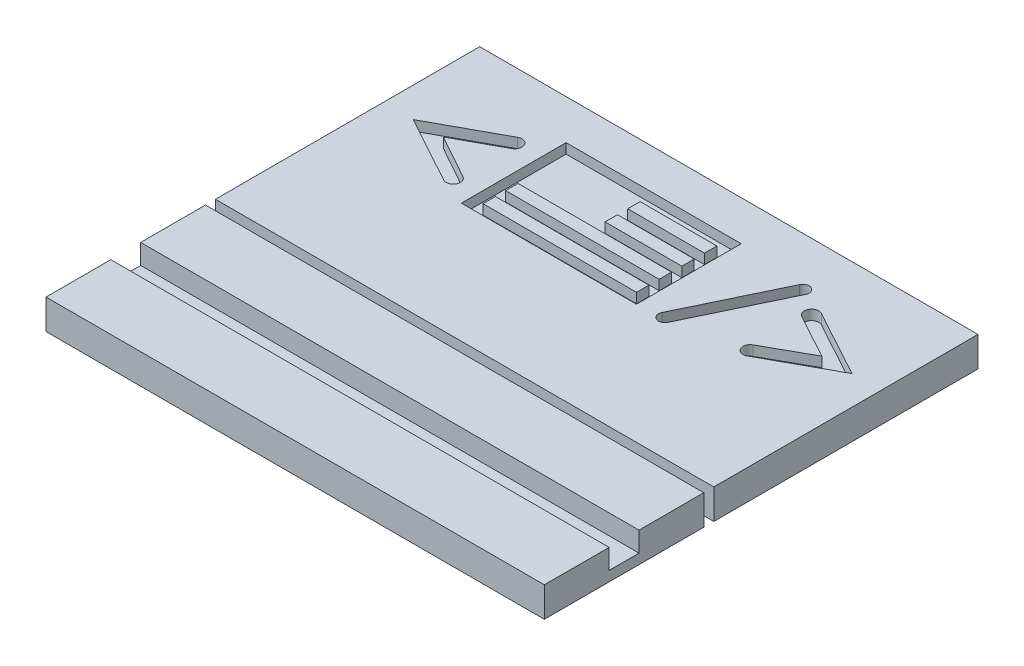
ISO-10303-21;
HEADER;
FILE_DESCRIPTION(('STEP AP214'),'2;1');
FILE_NAME('part.step','',(''),(''),'','','');
FILE_SCHEMA(('AUTOMOTIVE_DESIGN { 1 0 10303 214 1 1 1 1 }'));
ENDSEC;
DATA;
#1=APPLICATION_CONTEXT('core data for automotive mechanical design processes');
#2=APPLICATION_PROTOCOL_DEFINITION('international standard','automotive_design',2000,#1);
#3=PRODUCT_CONTEXT('',#1,'mechanical');
#4=PRODUCT('Part','Part','',(#3));
#5=PRODUCT_RELATED_PRODUCT_CATEGORY('part','',(#4));
#6=PRODUCT_DEFINITION_FORMATION('','',#4);
#7=PRODUCT_DEFINITION_CONTEXT('part definition',#1,'design');
#8=PRODUCT_DEFINITION('design','',#6,#7);
#9=PRODUCT_DEFINITION_SHAPE('','',#8);
#10=(LENGTH_UNIT() NAMED_UNIT(*) SI_UNIT(.MILLI.,.METRE.));
#11=(NAMED_UNIT(*) PLANE_ANGLE_UNIT() SI_UNIT($,.RADIAN.));
#12=(NAMED_UNIT(*) SI_UNIT($,.STERADIAN.) SOLID_ANGLE_UNIT());
#13=UNCERTAINTY_MEASURE_WITH_UNIT(LENGTH_MEASURE(1.E-05),#10,'distance_accuracy_value','');
#14=(GEOMETRIC_REPRESENTATION_CONTEXT(3) GLOBAL_UNCERTAINTY_ASSIGNED_CONTEXT((#13)) GLOBAL_UNIT_ASSIGNED_CONTEXT((#10,
#11,#12)) REPRESENTATION_CONTEXT('',''));
#15=CARTESIAN_POINT('',(0.,0.,0.));
#16=DIRECTION('',(0.,0.,1.));
#17=DIRECTION('',(1.,0.,0.));
#18=AXIS2_PLACEMENT_3D('',#15,#16,#17);
#19=CARTESIAN_POINT('',(0.,-19.05,-339.646560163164));
#20=DIRECTION('',(0.,0.,-1.));
#21=DIRECTION('',(-1.,0.,0.));
#22=AXIS2_PLACEMENT_3D('',#19,#20,#21);
#23=PLANE('',#22);
#24=DIRECTION('',(1.,0.,0.));
#25=VECTOR('',#24,1.);
#26=CARTESIAN_POINT('',(38.1,-15.875,-339.646560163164));
#27=LINE('',#26,#25);
#28=CARTESIAN_POINT('',(25.4,-15.875,-339.646560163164));
#29=VERTEX_POINT('',#28);
#30=CARTESIAN_POINT('',(38.1,-15.875,-339.646560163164));
#31=VERTEX_POINT('',#30);
#32=EDGE_CURVE('E435',#29,#31,#27,.T.);
#33=ORIENTED_EDGE('',*,*,#32,.T.);
#34=DIRECTION('',(0.,-1.,0.));
#35=VECTOR('',#34,1.);
#36=CARTESIAN_POINT('',(38.1,-15.875,-339.646560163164));
#37=LINE('',#36,#35);
#38=CARTESIAN_POINT('',(38.1,-19.05,-339.646560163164));
#39=VERTEX_POINT('',#38);
#40=EDGE_CURVE('E429',#31,#39,#37,.T.);
#41=ORIENTED_EDGE('',*,*,#40,.T.);
#42=DIRECTION('',(-1.,0.,0.));
#43=VECTOR('',#42,1.);
#44=CARTESIAN_POINT('',(0.,-19.05,-339.646560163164));
#45=LINE('',#44,#43);
#46=CARTESIAN_POINT('',(152.4,-19.05,-339.646560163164));
#47=VERTEX_POINT('',#46);
#48=EDGE_CURVE('E524',#47,#39,#45,.T.);
#49=ORIENTED_EDGE('',*,*,#48,.F.);
#50=DIRECTION('',(0.,-1.,0.));
#51=VECTOR('',#50,1.);
#52=CARTESIAN_POINT('',(152.4,-15.875,-339.646560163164));
#53=LINE('',#52,#51);
#54=CARTESIAN_POINT('',(152.4,-15.875,-339.646560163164));
#55=VERTEX_POINT('',#54);
#56=EDGE_CURVE('E462',#55,#47,#53,.T.);
#57=ORIENTED_EDGE('',*,*,#56,.F.);
#58=DIRECTION('',(1.,0.,0.));
#59=VECTOR('',#58,1.);
#60=CARTESIAN_POINT('',(165.1,-15.875,-339.646560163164));
#61=LINE('',#60,#59);
#62=CARTESIAN_POINT('',(165.1,-15.875,-339.646560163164));
#63=VERTEX_POINT('',#62);
#64=EDGE_CURVE('E451',#55,#63,#61,.T.);
#65=ORIENTED_EDGE('',*,*,#64,.T.);
#66=DIRECTION('',(0.,-1.,0.));
#67=VECTOR('',#66,1.);
#68=CARTESIAN_POINT('',(165.1,-15.875,-339.646560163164));
#69=LINE('',#68,#67);
#70=CARTESIAN_POINT('',(165.1,-19.05,-339.646560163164));
#71=VERTEX_POINT('',#70);
#72=EDGE_CURVE('E458',#63,#71,#69,.T.);
#73=ORIENTED_EDGE('',*,*,#72,.T.);
#74=CARTESIAN_POINT('',(279.4,-19.05,-339.646560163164));
#75=VERTEX_POINT('',#74);
#76=EDGE_CURVE('E525',#75,#71,#45,.T.);
#77=ORIENTED_EDGE('',*,*,#76,.F.);
#78=DIRECTION('',(0.,-1.,0.));
#79=VECTOR('',#78,1.);
#80=CARTESIAN_POINT('',(279.4,-15.875,-339.646560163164));
#81=LINE('',#80,#79);
#82=CARTESIAN_POINT('',(279.4,-15.875,-339.646560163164));
#83=VERTEX_POINT('',#82);
#84=EDGE_CURVE('E557',#83,#75,#81,.T.);
#85=ORIENTED_EDGE('',*,*,#84,.F.);
#86=DIRECTION('',(1.,0.,0.));
#87=VECTOR('',#86,1.);
#88=CARTESIAN_POINT('',(292.1,-15.875,-339.646560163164));
#89=LINE('',#88,#87);
#90=CARTESIAN_POINT('',(292.1,-15.875,-339.646560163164));
#91=VERTEX_POINT('',#90);
#92=EDGE_CURVE('E872',#83,#91,#89,.T.);
#93=ORIENTED_EDGE('',*,*,#92,.T.);
#94=DIRECTION('',(0.,-1.,0.));
#95=VECTOR('',#94,1.);
#96=CARTESIAN_POINT('',(292.1,-15.875,-339.646560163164));
#97=LINE('',#96,#95);
#98=CARTESIAN_POINT('',(292.1,-19.05,-339.646560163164));
#99=VERTEX_POINT('',#98);
#100=EDGE_CURVE('E553',#91,#99,#97,.T.);
#101=ORIENTED_EDGE('',*,*,#100,.T.);
#102=CARTESIAN_POINT('',(317.5,-19.05,-339.646560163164));
#103=VERTEX_POINT('',#102);
#104=EDGE_CURVE('E538',#103,#99,#45,.T.);
#105=ORIENTED_EDGE('',*,*,#104,.F.);
#106=DIRECTION('',(0.,1.,0.));
#107=VECTOR('',#106,1.);
#108=CARTESIAN_POINT('',(317.5,-19.05,-339.646560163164));
#109=LINE('',#108,#107);
#110=CARTESIAN_POINT('',(317.5,0.,-339.646560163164));
#111=VERTEX_POINT('',#110);
#112=EDGE_CURVE('E11',#103,#111,#109,.T.);
#113=ORIENTED_EDGE('',*,*,#112,.T.);
#114=DIRECTION('',(-1.,0.,0.));
#115=VECTOR('',#114,1.);
#116=CARTESIAN_POINT('',(0.,0.,-339.646560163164));
#117=LINE('',#116,#115);
#118=CARTESIAN_POINT('',(0.,0.,-339.646560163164));
#119=VERTEX_POINT('',#118);
#120=EDGE_CURVE('E43',#111,#119,#117,.T.);
#121=ORIENTED_EDGE('',*,*,#120,.T.);
#122=DIRECTION('',(0.,1.,0.));
#123=VECTOR('',#122,1.);
#124=CARTESIAN_POINT('',(0.,-19.05,-339.646560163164));
#125=LINE('',#124,#123);
#126=CARTESIAN_POINT('',(0.,-19.05,-339.646560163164));
#127=VERTEX_POINT('',#126);
#128=EDGE_CURVE('E548',#127,#119,#125,.T.);
#129=ORIENTED_EDGE('',*,*,#128,.F.);
#130=CARTESIAN_POINT('',(25.4,-19.05,-339.646560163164));
#131=VERTEX_POINT('',#130);
#132=EDGE_CURVE('E37',#131,#127,#45,.T.);
#133=ORIENTED_EDGE('',*,*,#132,.F.);
#134=DIRECTION('',(0.,-1.,0.));
#135=VECTOR('',#134,1.);
#136=CARTESIAN_POINT('',(25.4,-15.875,-339.646560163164));
#137=LINE('',#136,#135);
#138=EDGE_CURVE('E437',#29,#131,#137,.T.);
#139=ORIENTED_EDGE('',*,*,#138,.F.);
#140=EDGE_LOOP('',(#33,#41,#49,#57,#65,#73,#77,#85,#93,#101,#105,#113,#121,#129,#133,#139));
#141=FACE_BOUND('',#140,.T.);
#142=ADVANCED_FACE('F33',(#141),#23,.F.);
#143=CARTESIAN_POINT('',(0.,-19.05,0.));
#144=DIRECTION('',(-1.,0.,0.));
#145=DIRECTION('',(0.,0.,1.));
#146=AXIS2_PLACEMENT_3D('',#143,#144,#145);
#147=PLANE('',#146);
#148=ORIENTED_EDGE('',*,*,#128,.T.);
#149=DIRECTION('',(0.,0.,1.));
#150=VECTOR('',#149,1.);
#151=CARTESIAN_POINT('',(0.,0.,0.));
#152=LINE('',#151,#150);
#153=CARTESIAN_POINT('',(0.,0.,-508.));
#154=VERTEX_POINT('',#153);
#155=EDGE_CURVE('E541',#154,#119,#152,.T.);
#156=ORIENTED_EDGE('',*,*,#155,.F.);
#157=DIRECTION('',(0.,1.,0.));
#158=VECTOR('',#157,1.);
#159=CARTESIAN_POINT('',(0.,-19.05,-508.));
#160=LINE('',#159,#158);
#161=CARTESIAN_POINT('',(0.,-19.05,-508.));
#162=VERTEX_POINT('',#161);
#163=EDGE_CURVE('E826',#162,#154,#160,.T.);
#164=ORIENTED_EDGE('',*,*,#163,.F.);
#165=DIRECTION('',(0.,0.,1.));
#166=VECTOR('',#165,1.);
#167=CARTESIAN_POINT('',(0.,-19.05,0.));
#168=LINE('',#167,#166);
#169=EDGE_CURVE('E546',#162,#127,#168,.T.);
#170=ORIENTED_EDGE('',*,*,#169,.T.);
#171=EDGE_LOOP('',(#148,#156,#164,#170));
#172=FACE_BOUND('',#171,.T.);
#173=ADVANCED_FACE('F35',(#172),#147,.T.);
#174=CARTESIAN_POINT('',(317.5,-19.05,-508.));
#175=DIRECTION('',(1.,0.,0.));
#176=DIRECTION('',(0.,0.,-1.));
#177=AXIS2_PLACEMENT_3D('',#174,#175,#176);
#178=PLANE('',#177);
#179=ORIENTED_EDGE('',*,*,#112,.F.);
#180=DIRECTION('',(0.,0.,-1.));
#181=VECTOR('',#180,1.);
#182=CARTESIAN_POINT('',(317.5,-19.05,-508.));
#183=LINE('',#182,#181);
#184=CARTESIAN_POINT('',(317.5,-19.05,-508.));
#185=VERTEX_POINT('',#184);
#186=EDGE_CURVE('E530',#103,#185,#183,.T.);
#187=ORIENTED_EDGE('',*,*,#186,.T.);
#188=DIRECTION('',(0.,1.,0.));
#189=VECTOR('',#188,1.);
#190=CARTESIAN_POINT('',(317.5,-19.05,-508.));
#191=LINE('',#190,#189);
#192=CARTESIAN_POINT('',(317.5,0.,-508.));
#193=VERTEX_POINT('',#192);
#194=EDGE_CURVE('E552',#185,#193,#191,.T.);
#195=ORIENTED_EDGE('',*,*,#194,.T.);
#196=DIRECTION('',(0.,0.,-1.));
#197=VECTOR('',#196,1.);
#198=CARTESIAN_POINT('',(317.5,0.,-508.));
#199=LINE('',#198,#197);
#200=EDGE_CURVE('E544',#111,#193,#199,.T.);
#201=ORIENTED_EDGE('',*,*,#200,.F.);
#202=EDGE_LOOP('',(#179,#187,#195,#201));
#203=FACE_BOUND('',#202,.T.);
#204=ADVANCED_FACE('F928',(#203),#178,.T.);
#205=CARTESIAN_POINT('',(0.,-19.05,0.));
#206=DIRECTION('',(0.,-1.,0.));
#207=DIRECTION('',(0.,0.,-1.));
#208=AXIS2_PLACEMENT_3D('',#205,#206,#207);
#209=PLANE('',#208);
#210=ORIENTED_EDGE('',*,*,#48,.T.);
#211=DIRECTION('',(0.,0.,1.));
#212=VECTOR('',#211,1.);
#213=CARTESIAN_POINT('',(38.1,-19.05,-339.646560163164));
#214=LINE('',#213,#212);
#215=CARTESIAN_POINT('',(38.1,-19.05,-333.296560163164));
#216=VERTEX_POINT('',#215);
#217=EDGE_CURVE('E59',#39,#216,#214,.T.);
#218=ORIENTED_EDGE('',*,*,#217,.T.);
#219=DIRECTION('',(1.,0.,0.));
#220=VECTOR('',#219,1.);
#221=CARTESIAN_POINT('',(0.,-19.05,-333.296560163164));
#222=LINE('',#221,#220);
#223=CARTESIAN_POINT('',(152.4,-19.05,-333.296560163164));
#224=VERTEX_POINT('',#223);
#225=EDGE_CURVE('E433',#216,#224,#222,.T.);
#226=ORIENTED_EDGE('',*,*,#225,.T.);
#227=DIRECTION('',(0.,0.,-1.));
#228=VECTOR('',#227,1.);
#229=CARTESIAN_POINT('',(152.4,-19.05,-339.646560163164));
#230=LINE('',#229,#228);
#231=EDGE_CURVE('E446',#224,#47,#230,.T.);
#232=ORIENTED_EDGE('',*,*,#231,.T.);
#233=EDGE_LOOP('',(#210,#218,#226,#232));
#234=FACE_BOUND('',#233,.T.);
#235=ORIENTED_EDGE('',*,*,#76,.T.);
#236=DIRECTION('',(0.,0.,1.));
#237=VECTOR('',#236,1.);
#238=CARTESIAN_POINT('',(165.1,-19.05,-339.646560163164));
#239=LINE('',#238,#237);
#240=CARTESIAN_POINT('',(165.1,-19.05,-333.296560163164));
#241=VERTEX_POINT('',#240);
#242=EDGE_CURVE('E455',#71,#241,#239,.T.);
#243=ORIENTED_EDGE('',*,*,#242,.T.);
#244=CARTESIAN_POINT('',(279.4,-19.05,-333.296560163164));
#245=VERTEX_POINT('',#244);
#246=EDGE_CURVE('E519',#241,#245,#222,.T.);
#247=ORIENTED_EDGE('',*,*,#246,.T.);
#248=DIRECTION('',(0.,0.,-1.));
#249=VECTOR('',#248,1.);
#250=CARTESIAN_POINT('',(279.4,-19.05,-339.646560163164));
#251=LINE('',#250,#249);
#252=EDGE_CURVE('E887',#245,#75,#251,.T.);
#253=ORIENTED_EDGE('',*,*,#252,.T.);
#254=EDGE_LOOP('',(#235,#243,#247,#253));
#255=FACE_BOUND('',#254,.T.);
#256=ORIENTED_EDGE('',*,*,#104,.T.);
#257=DIRECTION('',(0.,0.,1.));
#258=VECTOR('',#257,1.);
#259=CARTESIAN_POINT('',(292.1,-19.05,-339.646560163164));
#260=LINE('',#259,#258);
#261=CARTESIAN_POINT('',(292.1,-19.05,-333.296560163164));
#262=VERTEX_POINT('',#261);
#263=EDGE_CURVE('E890',#99,#262,#260,.T.);
#264=ORIENTED_EDGE('',*,*,#263,.T.);
#265=CARTESIAN_POINT('',(317.5,-19.05,-333.296560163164));
#266=VERTEX_POINT('',#265);
#267=EDGE_CURVE('E512',#262,#266,#222,.T.);
#268=ORIENTED_EDGE('',*,*,#267,.T.);
#269=DIRECTION('',(0.,0.,-1.));
#270=VECTOR('',#269,1.);
#271=CARTESIAN_POINT('',(317.5,-19.05,-508.));
#272=LINE('',#271,#270);
#273=CARTESIAN_POINT('',(317.5,-19.05,-231.696560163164));
#274=VERTEX_POINT('',#273);
#275=EDGE_CURVE('E501',#274,#266,#272,.T.);
#276=ORIENTED_EDGE('',*,*,#275,.F.);
#277=DIRECTION('',(-1.,0.,0.));
#278=VECTOR('',#277,1.);
#279=CARTESIAN_POINT('',(0.,-19.05,-231.696560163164));
#280=LINE('',#279,#278);
#281=CARTESIAN_POINT('',(0.,-19.05,-231.696560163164));
#282=VERTEX_POINT('',#281);
#283=EDGE_CURVE('E486',#274,#282,#280,.T.);
#284=ORIENTED_EDGE('',*,*,#283,.T.);
#285=DIRECTION('',(0.,0.,1.));
#286=VECTOR('',#285,1.);
#287=CARTESIAN_POINT('',(0.,-19.05,0.));
#288=LINE('',#287,#286);
#289=CARTESIAN_POINT('',(0.,-19.05,-333.296560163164));
#290=VERTEX_POINT('',#289);
#291=EDGE_CURVE('E504',#290,#282,#288,.T.);
#292=ORIENTED_EDGE('',*,*,#291,.F.);
#293=CARTESIAN_POINT('',(25.4,-19.05,-333.296560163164));
#294=VERTEX_POINT('',#293);
#295=EDGE_CURVE('E516',#290,#294,#222,.T.);
#296=ORIENTED_EDGE('',*,*,#295,.T.);
#297=DIRECTION('',(0.,0.,-1.));
#298=VECTOR('',#297,1.);
#299=CARTESIAN_POINT('',(25.4,-19.05,-339.646560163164));
#300=LINE('',#299,#298);
#301=EDGE_CURVE('E51',#294,#131,#300,.T.);
#302=ORIENTED_EDGE('',*,*,#301,.T.);
#303=ORIENTED_EDGE('',*,*,#132,.T.);
#304=ORIENTED_EDGE('',*,*,#169,.F.);
#305=DIRECTION('',(-1.,0.,0.));
#306=VECTOR('',#305,1.);
#307=CARTESIAN_POINT('',(0.,-19.05,-508.));
#308=LINE('',#307,#306);
#309=EDGE_CURVE('E853',#185,#162,#308,.T.);
#310=ORIENTED_EDGE('',*,*,#309,.F.);
#311=ORIENTED_EDGE('',*,*,#186,.F.);
#312=EDGE_LOOP('',(#256,#264,#268,#276,#284,#292,#296,#302,#303,#304,#310,#311));
#313=FACE_BOUND('',#312,.T.);
#314=ADVANCED_FACE('F903',(#234,#255,#313),#209,.T.);
#315=CARTESIAN_POINT('',(0.,0.,0.));
#316=DIRECTION('',(0.,-1.,0.));
#317=DIRECTION('',(0.,0.,-1.));
#318=AXIS2_PLACEMENT_3D('',#315,#316,#317);
#319=PLANE('',#318);
#320=CARTESIAN_POINT('',(64.2555827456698,0.,-426.946180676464));
#321=DIRECTION('',(0.,1.,0.));
#322=DIRECTION('',(0.,0.,1.));
#323=AXIS2_PLACEMENT_3D('',#320,#321,#322);
#324=CIRCLE('',#323,4.52050302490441);
#325=CARTESIAN_POINT('',(62.0529386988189,0.,-422.998610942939));
#326=VERTEX_POINT('',#325);
#327=CARTESIAN_POINT('',(66.4582267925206,0.,-430.893750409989));
#328=VERTEX_POINT('',#327);
#329=EDGE_CURVE('E827',#326,#328,#324,.T.);
#330=ORIENTED_EDGE('',*,*,#329,.F.);
#331=DIRECTION('',(0.876424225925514,0.,0.481539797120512));
#332=VECTOR('',#331,1.);
#333=CARTESIAN_POINT('',(62.0529386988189,0.,-422.998610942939));
#334=LINE('',#333,#332);
#335=CARTESIAN_POINT('',(19.05,0.,-446.62601165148));
#336=VERTEX_POINT('',#335);
#337=EDGE_CURVE('E823',#336,#326,#334,.T.);
#338=ORIENTED_EDGE('',*,*,#337,.F.);
#339=DIRECTION('',(-0.877902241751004,0.,0.47883990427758));
#340=VECTOR('',#339,1.);
#341=CARTESIAN_POINT('',(19.05,0.,-446.62601165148));
#342=LINE('',#341,#340);
#343=CARTESIAN_POINT('',(62.0529386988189,0.,-470.081382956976));
#344=VERTEX_POINT('',#343);
#345=EDGE_CURVE('E843',#344,#336,#342,.T.);
#346=ORIENTED_EDGE('',*,*,#345,.F.);
#347=CARTESIAN_POINT('',(64.2555827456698,0.,-466.043068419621));
#348=DIRECTION('',(0.,1.,0.));
#349=DIRECTION('',(0.,0.,1.));
#350=AXIS2_PLACEMENT_3D('',#347,#348,#349);
#351=CIRCLE('',#350,4.59995924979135);
#352=CARTESIAN_POINT('',(66.4582267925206,0.,-462.004753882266));
#353=VERTEX_POINT('',#352);
#354=EDGE_CURVE('E839',#353,#344,#351,.T.);
#355=ORIENTED_EDGE('',*,*,#354,.F.);
#356=DIRECTION('',(0.877902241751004,0.,-0.478839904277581));
#357=VECTOR('',#356,1.);
#358=CARTESIAN_POINT('',(66.4582267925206,0.,-462.004753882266));
#359=LINE('',#358,#357);
#360=CARTESIAN_POINT('',(38.2629319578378,0.,-446.62601165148));
#361=VERTEX_POINT('',#360);
#362=EDGE_CURVE('E835',#361,#353,#359,.T.);
#363=ORIENTED_EDGE('',*,*,#362,.F.);
#364=DIRECTION('',(-0.873258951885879,0.,-0.487256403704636));
#365=VECTOR('',#364,1.);
#366=CARTESIAN_POINT('',(38.2629319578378,0.,-446.62601165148));
#367=LINE('',#366,#365);
#368=EDGE_CURVE('E831',#328,#361,#367,.T.);
#369=ORIENTED_EDGE('',*,*,#368,.F.);
#370=EDGE_LOOP('',(#330,#338,#346,#355,#363,#369));
#371=FACE_BOUND('',#370,.T.);
#372=DIRECTION('',(-0.432809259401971,0.,0.901485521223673));
#373=VECTOR('',#372,1.);
#374=CARTESIAN_POINT('',(233.218610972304,0.,-478.70386059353));
#375=LINE('',#374,#373);
#376=CARTESIAN_POINT('',(233.218610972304,0.,-478.70386059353));
#377=VERTEX_POINT('',#376);
#378=CARTESIAN_POINT('',(204.73024610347,0.,-419.366293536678));
#379=VERTEX_POINT('',#378);
#380=EDGE_CURVE('E789',#377,#379,#375,.T.);
#381=ORIENTED_EDGE('',*,*,#380,.F.);
#382=CARTESIAN_POINT('',(236.884184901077,0.,-476.943993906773));
#383=DIRECTION('',(0.,1.,0.));
#384=DIRECTION('',(0.,0.,1.));
#385=AXIS2_PLACEMENT_3D('',#382,#383,#384);
#386=CIRCLE('',#385,4.06614842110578);
#387=CARTESIAN_POINT('',(240.54975882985,0.,-475.184127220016));
#388=VERTEX_POINT('',#387);
#389=EDGE_CURVE('E785',#388,#377,#386,.T.);
#390=ORIENTED_EDGE('',*,*,#389,.F.);
#391=DIRECTION('',(0.432809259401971,0.,-0.901485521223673));
#392=VECTOR('',#391,1.);
#393=CARTESIAN_POINT('',(240.54975882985,0.,-475.184127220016));
#394=LINE('',#393,#392);
#395=CARTESIAN_POINT('',(212.061393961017,0.,-415.846560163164));
#396=VERTEX_POINT('',#395);
#397=EDGE_CURVE('E797',#396,#388,#394,.T.);
#398=ORIENTED_EDGE('',*,*,#397,.F.);
#399=CARTESIAN_POINT('',(208.395820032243,0.,-417.606426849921));
#400=DIRECTION('',(0.,1.,0.));
#401=DIRECTION('',(0.,0.,1.));
#402=AXIS2_PLACEMENT_3D('',#399,#400,#401);
#403=CIRCLE('',#402,4.06614842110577);
#404=EDGE_CURVE('E793',#379,#396,#403,.T.);
#405=ORIENTED_EDGE('',*,*,#404,.F.);
#406=EDGE_LOOP('',(#381,#390,#398,#405));
#407=FACE_BOUND('',#406,.T.);
#408=DIRECTION('',(1.,0.,0.));
#409=VECTOR('',#408,1.);
#410=CARTESIAN_POINT('',(80.4739864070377,0.,-415.846560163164));
#411=LINE('',#410,#409);
#412=CARTESIAN_POINT('',(80.4739864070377,0.,-415.846560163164));
#413=VERTEX_POINT('',#412);
#414=CARTESIAN_POINT('',(192.030020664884,0.,-415.846560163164));
#415=VERTEX_POINT('',#414);
#416=EDGE_CURVE('E757',#413,#415,#411,.T.);
#417=ORIENTED_EDGE('',*,*,#416,.F.);
#418=DIRECTION('',(0.,0.,1.));
#419=VECTOR('',#418,1.);
#420=CARTESIAN_POINT('',(80.4739864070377,0.,-482.6));
#421=LINE('',#420,#419);
#422=CARTESIAN_POINT('',(80.4739864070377,0.,-482.6));
#423=VERTEX_POINT('',#422);
#424=EDGE_CURVE('E753',#423,#413,#421,.T.);
#425=ORIENTED_EDGE('',*,*,#424,.F.);
#426=DIRECTION('',(-1.,0.,0.));
#427=VECTOR('',#426,1.);
#428=CARTESIAN_POINT('',(80.4739864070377,0.,-482.6));
#429=LINE('',#428,#427);
#430=CARTESIAN_POINT('',(192.030020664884,0.,-482.6));
#431=VERTEX_POINT('',#430);
#432=EDGE_CURVE('E765',#431,#423,#429,.T.);
#433=ORIENTED_EDGE('',*,*,#432,.F.);
#434=DIRECTION('',(0.,0.,-1.));
#435=VECTOR('',#434,1.);
#436=CARTESIAN_POINT('',(192.030020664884,0.,-482.6));
#437=LINE('',#436,#435);
#438=EDGE_CURVE('E761',#415,#431,#437,.T.);
#439=ORIENTED_EDGE('',*,*,#438,.F.);
#440=EDGE_LOOP('',(#417,#425,#433,#439));
#441=FACE_BOUND('',#440,.T.);
#442=DIRECTION('',(-0.87325895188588,0.,0.487256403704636));
#443=VECTOR('',#442,1.);
#444=CARTESIAN_POINT('',(279.752110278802,0.,-446.252948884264));
#445=LINE('',#444,#443);
#446=CARTESIAN_POINT('',(279.752110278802,0.,-446.252948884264));
#447=VERTEX_POINT('',#446);
#448=CARTESIAN_POINT('',(251.556815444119,0.,-430.520687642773));
#449=VERTEX_POINT('',#448);
#450=EDGE_CURVE('E583',#447,#449,#445,.T.);
#451=ORIENTED_EDGE('',*,*,#450,.F.);
#452=DIRECTION('',(0.877902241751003,0.,0.478839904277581));
#453=VECTOR('',#452,1.);
#454=CARTESIAN_POINT('',(251.556815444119,0.,-461.63169111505));
#455=LINE('',#454,#453);
#456=CARTESIAN_POINT('',(251.556815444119,0.,-461.63169111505));
#457=VERTEX_POINT('',#456);
#458=EDGE_CURVE('E579',#457,#447,#455,.T.);
#459=ORIENTED_EDGE('',*,*,#458,.F.);
#460=CARTESIAN_POINT('',(253.75945949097,0.,-465.670005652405));
#461=DIRECTION('',(0.,1.,0.));
#462=DIRECTION('',(0.,0.,-1.));
#463=AXIS2_PLACEMENT_3D('',#460,#461,#462);
#464=CIRCLE('',#463,4.59995924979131);
#465=CARTESIAN_POINT('',(255.962103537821,0.,-469.70832018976));
#466=VERTEX_POINT('',#465);
#467=EDGE_CURVE('E599',#466,#457,#464,.T.);
#468=ORIENTED_EDGE('',*,*,#467,.F.);
#469=DIRECTION('',(-0.877902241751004,0.,-0.478839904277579));
#470=VECTOR('',#469,1.);
#471=CARTESIAN_POINT('',(298.96504223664,0.,-446.252948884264));
#472=LINE('',#471,#470);
#473=CARTESIAN_POINT('',(298.96504223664,0.,-446.252948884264));
#474=VERTEX_POINT('',#473);
#475=EDGE_CURVE('E595',#474,#466,#472,.T.);
#476=ORIENTED_EDGE('',*,*,#475,.F.);
#477=DIRECTION('',(0.876424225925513,0.,-0.481539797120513));
#478=VECTOR('',#477,1.);
#479=CARTESIAN_POINT('',(255.962103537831,0.,-422.625548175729));
#480=LINE('',#479,#478);
#481=CARTESIAN_POINT('',(255.962103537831,0.,-422.625548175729));
#482=VERTEX_POINT('',#481);
#483=EDGE_CURVE('E591',#482,#474,#480,.T.);
#484=ORIENTED_EDGE('',*,*,#483,.F.);
#485=CARTESIAN_POINT('',(253.75945949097,0.,-426.573117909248));
#486=DIRECTION('',(0.,1.,0.));
#487=DIRECTION('',(0.,0.,-1.));
#488=AXIS2_PLACEMENT_3D('',#485,#486,#487);
#489=CIRCLE('',#488,4.52050302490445);
#490=EDGE_CURVE('E587',#449,#482,#489,.T.);
#491=ORIENTED_EDGE('',*,*,#490,.F.);
#492=EDGE_LOOP('',(#451,#459,#468,#476,#484,#491));
#493=FACE_BOUND('',#492,.T.);
#494=ORIENTED_EDGE('',*,*,#155,.T.);
#495=ORIENTED_EDGE('',*,*,#120,.F.);
#496=ORIENTED_EDGE('',*,*,#200,.T.);
#497=DIRECTION('',(-1.,0.,0.));
#498=VECTOR('',#497,1.);
#499=CARTESIAN_POINT('',(0.,0.,-508.));
#500=LINE('',#499,#498);
#501=EDGE_CURVE('E545',#193,#154,#500,.T.);
#502=ORIENTED_EDGE('',*,*,#501,.T.);
#503=EDGE_LOOP('',(#494,#495,#496,#502));
#504=FACE_BOUND('',#503,.T.);
#505=ADVANCED_FACE('F935',(#371,#407,#441,#493,#504),#319,.F.);
#506=CARTESIAN_POINT('',(0.,-19.05,-508.));
#507=DIRECTION('',(0.,0.,-1.));
#508=DIRECTION('',(-1.,0.,0.));
#509=AXIS2_PLACEMENT_3D('',#506,#507,#508);
#510=PLANE('',#509);
#511=ORIENTED_EDGE('',*,*,#501,.F.);
#512=ORIENTED_EDGE('',*,*,#194,.F.);
#513=ORIENTED_EDGE('',*,*,#309,.T.);
#514=ORIENTED_EDGE('',*,*,#163,.T.);
#515=EDGE_LOOP('',(#511,#512,#513,#514));
#516=FACE_BOUND('',#515,.T.);
#517=ADVANCED_FACE('F937',(#516),#510,.T.);
#518=CARTESIAN_POINT('',(62.0529386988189,-6.35,-422.998610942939));
#519=DIRECTION('',(-0.481539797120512,0.,0.876424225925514));
#520=DIRECTION('',(0.876424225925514,0.,0.481539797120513));
#521=AXIS2_PLACEMENT_3D('',#518,#519,#520);
#522=PLANE('',#521);
#523=ORIENTED_EDGE('',*,*,#337,.T.);
#524=DIRECTION('',(0.,1.,0.));
#525=VECTOR('',#524,1.);
#526=CARTESIAN_POINT('',(62.0529386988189,-6.35,-422.998610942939));
#527=LINE('',#526,#525);
#528=CARTESIAN_POINT('',(62.0529386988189,-6.35,-422.998610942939));
#529=VERTEX_POINT('',#528);
#530=EDGE_CURVE('E809',#529,#326,#527,.T.);
#531=ORIENTED_EDGE('',*,*,#530,.F.);
#532=DIRECTION('',(0.876424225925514,0.,0.481539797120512));
#533=VECTOR('',#532,1.);
#534=CARTESIAN_POINT('',(62.0529386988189,-6.35,-422.998610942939));
#535=LINE('',#534,#533);
#536=CARTESIAN_POINT('',(19.05,-6.35,-446.62601165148));
#537=VERTEX_POINT('',#536);
#538=EDGE_CURVE('E805',#537,#529,#535,.T.);
#539=ORIENTED_EDGE('',*,*,#538,.F.);
#540=DIRECTION('',(0.,1.,0.));
#541=VECTOR('',#540,1.);
#542=CARTESIAN_POINT('',(19.05,-6.35,-446.62601165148));
#543=LINE('',#542,#541);
#544=EDGE_CURVE('E825',#537,#336,#543,.T.);
#545=ORIENTED_EDGE('',*,*,#544,.T.);
#546=EDGE_LOOP('',(#523,#531,#539,#545));
#547=FACE_BOUND('',#546,.T.);
#548=ADVANCED_FACE('F1058',(#547),#522,.F.);
#549=CARTESIAN_POINT('',(19.05,-6.35,-446.62601165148));
#550=DIRECTION('',(-0.47883990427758,0.,-0.877902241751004));
#551=DIRECTION('',(-0.877902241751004,0.,0.47883990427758));
#552=AXIS2_PLACEMENT_3D('',#549,#550,#551);
#553=PLANE('',#552);
#554=ORIENTED_EDGE('',*,*,#345,.T.);
#555=ORIENTED_EDGE('',*,*,#544,.F.);
#556=DIRECTION('',(-0.877902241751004,0.,0.47883990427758));
#557=VECTOR('',#556,1.);
#558=CARTESIAN_POINT('',(19.05,-6.35,-446.62601165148));
#559=LINE('',#558,#557);
#560=CARTESIAN_POINT('',(62.0529386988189,-6.35,-470.081382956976));
#561=VERTEX_POINT('',#560);
#562=EDGE_CURVE('E788',#561,#537,#559,.T.);
#563=ORIENTED_EDGE('',*,*,#562,.F.);
#564=DIRECTION('',(0.,1.,0.));
#565=VECTOR('',#564,1.);
#566=CARTESIAN_POINT('',(62.0529386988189,-6.35,-470.081382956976));
#567=LINE('',#566,#565);
#568=EDGE_CURVE('E842',#561,#344,#567,.T.);
#569=ORIENTED_EDGE('',*,*,#568,.T.);
#570=EDGE_LOOP('',(#554,#555,#563,#569));
#571=FACE_BOUND('',#570,.T.);
#572=ADVANCED_FACE('F1061',(#571),#553,.F.);
#573=CARTESIAN_POINT('',(64.2555827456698,-6.35,-466.043068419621));
#574=DIRECTION('',(0.,1.,0.));
#575=DIRECTION('',(0.,0.,1.));
#576=AXIS2_PLACEMENT_3D('',#573,#574,#575);
#577=CYLINDRICAL_SURFACE('',#576,4.59995924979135);
#578=ORIENTED_EDGE('',*,*,#354,.T.);
#579=ORIENTED_EDGE('',*,*,#568,.F.);
#580=CARTESIAN_POINT('',(64.2555827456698,-6.35,-466.043068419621));
#581=DIRECTION('',(0.,1.,0.));
#582=DIRECTION('',(0.,0.,1.));
#583=AXIS2_PLACEMENT_3D('',#580,#581,#582);
#584=CIRCLE('',#583,4.59995924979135);
#585=CARTESIAN_POINT('',(66.4582267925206,-6.35,-462.004753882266));
#586=VERTEX_POINT('',#585);
#587=EDGE_CURVE('E818',#586,#561,#584,.T.);
#588=ORIENTED_EDGE('',*,*,#587,.F.);
#589=DIRECTION('',(0.,1.,0.));
#590=VECTOR('',#589,1.);
#591=CARTESIAN_POINT('',(66.4582267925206,-6.35,-462.004753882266));
#592=LINE('',#591,#590);
#593=EDGE_CURVE('E838',#586,#353,#592,.T.);
#594=ORIENTED_EDGE('',*,*,#593,.T.);
#595=EDGE_LOOP('',(#578,#579,#588,#594));
#596=FACE_BOUND('',#595,.T.);
#597=ADVANCED_FACE('F1075',(#596),#577,.F.);
#598=CARTESIAN_POINT('',(66.4582267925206,-6.35,-462.004753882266));
#599=DIRECTION('',(0.478839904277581,0.,0.877902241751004));
#600=DIRECTION('',(0.877902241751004,0.,-0.478839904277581));
#601=AXIS2_PLACEMENT_3D('',#598,#599,#600);
#602=PLANE('',#601);
#603=ORIENTED_EDGE('',*,*,#362,.T.);
#604=ORIENTED_EDGE('',*,*,#593,.F.);
#605=DIRECTION('',(0.877902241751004,0.,-0.478839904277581));
#606=VECTOR('',#605,1.);
#607=CARTESIAN_POINT('',(66.4582267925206,-6.35,-462.004753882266));
#608=LINE('',#607,#606);
#609=CARTESIAN_POINT('',(38.2629319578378,-6.35,-446.62601165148));
#610=VERTEX_POINT('',#609);
#611=EDGE_CURVE('E815',#610,#586,#608,.T.);
#612=ORIENTED_EDGE('',*,*,#611,.F.);
#613=DIRECTION('',(0.,1.,0.));
#614=VECTOR('',#613,1.);
#615=CARTESIAN_POINT('',(38.2629319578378,-6.35,-446.62601165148));
#616=LINE('',#615,#614);
#617=EDGE_CURVE('E834',#610,#361,#616,.T.);
#618=ORIENTED_EDGE('',*,*,#617,.T.);
#619=EDGE_LOOP('',(#603,#604,#612,#618));
#620=FACE_BOUND('',#619,.T.);
#621=ADVANCED_FACE('F1071',(#620),#602,.F.);
#622=CARTESIAN_POINT('',(38.2629319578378,-6.35,-446.62601165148));
#623=DIRECTION('',(0.487256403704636,0.,-0.87325895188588));
#624=DIRECTION('',(-0.873258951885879,0.,-0.487256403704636));
#625=AXIS2_PLACEMENT_3D('',#622,#623,#624);
#626=PLANE('',#625);
#627=ORIENTED_EDGE('',*,*,#368,.T.);
#628=ORIENTED_EDGE('',*,*,#617,.F.);
#629=DIRECTION('',(-0.873258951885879,0.,-0.487256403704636));
#630=VECTOR('',#629,1.);
#631=CARTESIAN_POINT('',(38.2629319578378,-6.35,-446.62601165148));
#632=LINE('',#631,#630);
#633=CARTESIAN_POINT('',(66.4582267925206,-6.35,-430.893750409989));
#634=VERTEX_POINT('',#633);
#635=EDGE_CURVE('E812',#634,#610,#632,.T.);
#636=ORIENTED_EDGE('',*,*,#635,.F.);
#637=DIRECTION('',(0.,1.,0.));
#638=VECTOR('',#637,1.);
#639=CARTESIAN_POINT('',(66.4582267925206,-6.35,-430.893750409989));
#640=LINE('',#639,#638);
#641=EDGE_CURVE('E830',#634,#328,#640,.T.);
#642=ORIENTED_EDGE('',*,*,#641,.T.);
#643=EDGE_LOOP('',(#627,#628,#636,#642));
#644=FACE_BOUND('',#643,.T.);
#645=ADVANCED_FACE('F1067',(#644),#626,.F.);
#646=CARTESIAN_POINT('',(64.2555827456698,-6.35,-426.946180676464));
#647=DIRECTION('',(0.,1.,0.));
#648=DIRECTION('',(0.,0.,1.));
#649=AXIS2_PLACEMENT_3D('',#646,#647,#648);
#650=CYLINDRICAL_SURFACE('',#649,4.52050302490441);
#651=ORIENTED_EDGE('',*,*,#329,.T.);
#652=ORIENTED_EDGE('',*,*,#641,.F.);
#653=CARTESIAN_POINT('',(64.2555827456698,-6.35,-426.946180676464));
#654=DIRECTION('',(0.,1.,0.));
#655=DIRECTION('',(0.,0.,1.));
#656=AXIS2_PLACEMENT_3D('',#653,#654,#655);
#657=CIRCLE('',#656,4.52050302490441);
#658=EDGE_CURVE('E808',#529,#634,#657,.T.);
#659=ORIENTED_EDGE('',*,*,#658,.F.);
#660=ORIENTED_EDGE('',*,*,#530,.T.);
#661=EDGE_LOOP('',(#651,#652,#659,#660));
#662=FACE_BOUND('',#661,.T.);
#663=ADVANCED_FACE('F1063',(#662),#650,.F.);
#664=CARTESIAN_POINT('',(64.2555827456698,-6.35,-466.043068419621));
#665=DIRECTION('',(0.,1.,0.));
#666=DIRECTION('',(0.,0.,1.));
#667=AXIS2_PLACEMENT_3D('',#664,#665,#666);
#668=PLANE('',#667);
#669=ORIENTED_EDGE('',*,*,#538,.T.);
#670=ORIENTED_EDGE('',*,*,#658,.T.);
#671=ORIENTED_EDGE('',*,*,#635,.T.);
#672=ORIENTED_EDGE('',*,*,#611,.T.);
#673=ORIENTED_EDGE('',*,*,#587,.T.);
#674=ORIENTED_EDGE('',*,*,#562,.T.);
#675=EDGE_LOOP('',(#669,#670,#671,#672,#673,#674));
#676=FACE_BOUND('',#675,.T.);
#677=ADVANCED_FACE('F1066',(#676),#668,.T.);
#678=CARTESIAN_POINT('',(236.884184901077,-6.35,-476.943993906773));
#679=DIRECTION('',(0.,1.,0.));
#680=DIRECTION('',(0.,0.,1.));
#681=AXIS2_PLACEMENT_3D('',#678,#679,#680);
#682=CYLINDRICAL_SURFACE('',#681,4.06614842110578);
#683=ORIENTED_EDGE('',*,*,#389,.T.);
#684=DIRECTION('',(0.,1.,0.));
#685=VECTOR('',#684,1.);
#686=CARTESIAN_POINT('',(233.218610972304,-6.35,-478.70386059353));
#687=LINE('',#686,#685);
#688=CARTESIAN_POINT('',(233.218610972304,-6.35,-478.70386059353));
#689=VERTEX_POINT('',#688);
#690=EDGE_CURVE('E777',#689,#377,#687,.T.);
#691=ORIENTED_EDGE('',*,*,#690,.F.);
#692=CARTESIAN_POINT('',(236.884184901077,-6.35,-476.943993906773));
#693=DIRECTION('',(0.,1.,0.));
#694=DIRECTION('',(0.,0.,1.));
#695=AXIS2_PLACEMENT_3D('',#692,#693,#694);
#696=CIRCLE('',#695,4.06614842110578);
#697=CARTESIAN_POINT('',(240.54975882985,-6.35,-475.184127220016));
#698=VERTEX_POINT('',#697);
#699=EDGE_CURVE('E773',#698,#689,#696,.T.);
#700=ORIENTED_EDGE('',*,*,#699,.F.);
#701=DIRECTION('',(0.,1.,0.));
#702=VECTOR('',#701,1.);
#703=CARTESIAN_POINT('',(240.54975882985,-6.35,-475.184127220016));
#704=LINE('',#703,#702);
#705=EDGE_CURVE('E787',#698,#388,#704,.T.);
#706=ORIENTED_EDGE('',*,*,#705,.T.);
#707=EDGE_LOOP('',(#683,#691,#700,#706));
#708=FACE_BOUND('',#707,.T.);
#709=ADVANCED_FACE('F1085',(#708),#682,.F.);
#710=CARTESIAN_POINT('',(240.54975882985,-6.35,-475.184127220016));
#711=DIRECTION('',(0.901485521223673,0.,0.432809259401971));
#712=DIRECTION('',(0.432809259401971,0.,-0.901485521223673));
#713=AXIS2_PLACEMENT_3D('',#710,#711,#712);
#714=PLANE('',#713);
#715=ORIENTED_EDGE('',*,*,#397,.T.);
#716=ORIENTED_EDGE('',*,*,#705,.F.);
#717=DIRECTION('',(0.432809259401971,0.,-0.901485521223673));
#718=VECTOR('',#717,1.);
#719=CARTESIAN_POINT('',(240.54975882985,-6.35,-475.184127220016));
#720=LINE('',#719,#718);
#721=CARTESIAN_POINT('',(212.061393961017,-6.35,-415.846560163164));
#722=VERTEX_POINT('',#721);
#723=EDGE_CURVE('E756',#722,#698,#720,.T.);
#724=ORIENTED_EDGE('',*,*,#723,.F.);
#725=DIRECTION('',(0.,1.,0.));
#726=VECTOR('',#725,1.);
#727=CARTESIAN_POINT('',(212.061393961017,-6.35,-415.846560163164));
#728=LINE('',#727,#726);
#729=EDGE_CURVE('E796',#722,#396,#728,.T.);
#730=ORIENTED_EDGE('',*,*,#729,.T.);
#731=EDGE_LOOP('',(#715,#716,#724,#730));
#732=FACE_BOUND('',#731,.T.);
#733=ADVANCED_FACE('F1089',(#732),#714,.F.);
#734=CARTESIAN_POINT('',(208.395820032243,-6.35,-417.606426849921));
#735=DIRECTION('',(0.,1.,0.));
#736=DIRECTION('',(0.,0.,1.));
#737=AXIS2_PLACEMENT_3D('',#734,#735,#736);
#738=CYLINDRICAL_SURFACE('',#737,4.06614842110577);
#739=ORIENTED_EDGE('',*,*,#404,.T.);
#740=ORIENTED_EDGE('',*,*,#729,.F.);
#741=CARTESIAN_POINT('',(208.395820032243,-6.35,-417.606426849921));
#742=DIRECTION('',(0.,1.,0.));
#743=DIRECTION('',(0.,0.,1.));
#744=AXIS2_PLACEMENT_3D('',#741,#742,#743);
#745=CIRCLE('',#744,4.06614842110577);
#746=CARTESIAN_POINT('',(204.73024610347,-6.35,-419.366293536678));
#747=VERTEX_POINT('',#746);
#748=EDGE_CURVE('E780',#747,#722,#745,.T.);
#749=ORIENTED_EDGE('',*,*,#748,.F.);
#750=DIRECTION('',(0.,1.,0.));
#751=VECTOR('',#750,1.);
#752=CARTESIAN_POINT('',(204.73024610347,-6.35,-419.366293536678));
#753=LINE('',#752,#751);
#754=EDGE_CURVE('E792',#747,#379,#753,.T.);
#755=ORIENTED_EDGE('',*,*,#754,.T.);
#756=EDGE_LOOP('',(#739,#740,#749,#755));
#757=FACE_BOUND('',#756,.T.);
#758=ADVANCED_FACE('F1095',(#757),#738,.F.);
#759=CARTESIAN_POINT('',(233.218610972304,-6.35,-478.70386059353));
#760=DIRECTION('',(-0.901485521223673,0.,-0.432809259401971));
#761=DIRECTION('',(-0.432809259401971,0.,0.901485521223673));
#762=AXIS2_PLACEMENT_3D('',#759,#760,#761);
#763=PLANE('',#762);
#764=ORIENTED_EDGE('',*,*,#380,.T.);
#765=ORIENTED_EDGE('',*,*,#754,.F.);
#766=DIRECTION('',(-0.432809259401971,0.,0.901485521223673));
#767=VECTOR('',#766,1.);
#768=CARTESIAN_POINT('',(233.218610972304,-6.35,-478.70386059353));
#769=LINE('',#768,#767);
#770=EDGE_CURVE('E776',#689,#747,#769,.T.);
#771=ORIENTED_EDGE('',*,*,#770,.F.);
#772=ORIENTED_EDGE('',*,*,#690,.T.);
#773=EDGE_LOOP('',(#764,#765,#771,#772));
#774=FACE_BOUND('',#773,.T.);
#775=ADVANCED_FACE('F1091',(#774),#763,.F.);
#776=CARTESIAN_POINT('',(236.884184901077,-6.35,-476.943993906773));
#777=DIRECTION('',(0.,1.,0.));
#778=DIRECTION('',(0.,0.,1.));
#779=AXIS2_PLACEMENT_3D('',#776,#777,#778);
#780=PLANE('',#779);
#781=ORIENTED_EDGE('',*,*,#699,.T.);
#782=ORIENTED_EDGE('',*,*,#770,.T.);
#783=ORIENTED_EDGE('',*,*,#748,.T.);
#784=ORIENTED_EDGE('',*,*,#723,.T.);
#785=EDGE_LOOP('',(#781,#782,#783,#784));
#786=FACE_BOUND('',#785,.T.);
#787=ADVANCED_FACE('F1094',(#786),#780,.T.);
#788=CARTESIAN_POINT('',(80.4739864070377,-6.35,-482.6));
#789=DIRECTION('',(-1.,0.,0.));
#790=DIRECTION('',(0.,0.,1.));
#791=AXIS2_PLACEMENT_3D('',#788,#789,#790);
#792=PLANE('',#791);
#793=ORIENTED_EDGE('',*,*,#424,.T.);
#794=DIRECTION('',(0.,1.,0.));
#795=VECTOR('',#794,1.);
#796=CARTESIAN_POINT('',(80.4739864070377,-6.35,-415.846560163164));
#797=LINE('',#796,#795);
#798=CARTESIAN_POINT('',(80.4739864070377,-6.35,-415.846560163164));
#799=VERTEX_POINT('',#798);
#800=EDGE_CURVE('E745',#799,#413,#797,.T.);
#801=ORIENTED_EDGE('',*,*,#800,.F.);
#802=DIRECTION('',(0.,0.,1.));
#803=VECTOR('',#802,1.);
#804=CARTESIAN_POINT('',(80.4739864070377,-6.35,-482.6));
#805=LINE('',#804,#803);
#806=CARTESIAN_POINT('',(80.4739864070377,-6.35,-482.6));
#807=VERTEX_POINT('',#806);
#808=EDGE_CURVE('E741',#807,#799,#805,.T.);
#809=ORIENTED_EDGE('',*,*,#808,.F.);
#810=DIRECTION('',(0.,1.,0.));
#811=VECTOR('',#810,1.);
#812=CARTESIAN_POINT('',(80.4739864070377,-6.35,-482.6));
#813=LINE('',#812,#811);
#814=EDGE_CURVE('E755',#807,#423,#813,.T.);
#815=ORIENTED_EDGE('',*,*,#814,.T.);
#816=EDGE_LOOP('',(#793,#801,#809,#815));
#817=FACE_BOUND('',#816,.T.);
#818=ADVANCED_FACE('F1105',(#817),#792,.F.);
#819=CARTESIAN_POINT('',(80.4739864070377,-6.35,-482.6));
#820=DIRECTION('',(0.,0.,-1.));
#821=DIRECTION('',(-1.,0.,0.));
#822=AXIS2_PLACEMENT_3D('',#819,#820,#821);
#823=PLANE('',#822);
#824=ORIENTED_EDGE('',*,*,#432,.T.);
#825=ORIENTED_EDGE('',*,*,#814,.F.);
#826=DIRECTION('',(-1.,0.,0.));
#827=VECTOR('',#826,1.);
#828=CARTESIAN_POINT('',(80.4739864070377,-6.35,-482.6));
#829=LINE('',#828,#827);
#830=CARTESIAN_POINT('',(192.030020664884,-6.35,-482.6));
#831=VERTEX_POINT('',#830);
#832=EDGE_CURVE('E714',#831,#807,#829,.T.);
#833=ORIENTED_EDGE('',*,*,#832,.F.);
#834=DIRECTION('',(0.,1.,0.));
#835=VECTOR('',#834,1.);
#836=CARTESIAN_POINT('',(192.030020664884,-6.35,-482.6));
#837=LINE('',#836,#835);
#838=EDGE_CURVE('E764',#831,#431,#837,.T.);
#839=ORIENTED_EDGE('',*,*,#838,.T.);
#840=EDGE_LOOP('',(#824,#825,#833,#839));
#841=FACE_BOUND('',#840,.T.);
#842=ADVANCED_FACE('F1109',(#841),#823,.F.);
#843=CARTESIAN_POINT('',(192.030020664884,-6.35,-482.6));
#844=DIRECTION('',(1.,0.,0.));
#845=DIRECTION('',(0.,0.,-1.));
#846=AXIS2_PLACEMENT_3D('',#843,#844,#845);
#847=PLANE('',#846);
#848=ORIENTED_EDGE('',*,*,#438,.T.);
#849=ORIENTED_EDGE('',*,*,#838,.F.);
#850=DIRECTION('',(0.,0.,-1.));
#851=VECTOR('',#850,1.);
#852=CARTESIAN_POINT('',(192.030020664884,-6.35,-482.6));
#853=LINE('',#852,#851);
#854=CARTESIAN_POINT('',(192.030020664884,-6.35,-415.846560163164));
#855=VERTEX_POINT('',#854);
#856=EDGE_CURVE('E748',#855,#831,#853,.T.);
#857=ORIENTED_EDGE('',*,*,#856,.F.);
#858=DIRECTION('',(0.,1.,0.));
#859=VECTOR('',#858,1.);
#860=CARTESIAN_POINT('',(192.030020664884,-6.35,-415.846560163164));
#861=LINE('',#860,#859);
#862=EDGE_CURVE('E760',#855,#415,#861,.T.);
#863=ORIENTED_EDGE('',*,*,#862,.T.);
#864=EDGE_LOOP('',(#848,#849,#857,#863));
#865=FACE_BOUND('',#864,.T.);
#866=ADVANCED_FACE('F1115',(#865),#847,.F.);
#867=CARTESIAN_POINT('',(80.4739864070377,-6.35,-415.846560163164));
#868=DIRECTION('',(0.,0.,1.));
#869=DIRECTION('',(1.,0.,0.));
#870=AXIS2_PLACEMENT_3D('',#867,#868,#869);
#871=PLANE('',#870);
#872=ORIENTED_EDGE('',*,*,#416,.T.);
#873=ORIENTED_EDGE('',*,*,#862,.F.);
#874=DIRECTION('',(1.,0.,0.));
#875=VECTOR('',#874,1.);
#876=CARTESIAN_POINT('',(80.4739864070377,-6.35,-415.846560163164));
#877=LINE('',#876,#875);
#878=EDGE_CURVE('E744',#799,#855,#877,.T.);
#879=ORIENTED_EDGE('',*,*,#878,.F.);
#880=ORIENTED_EDGE('',*,*,#800,.T.);
#881=EDGE_LOOP('',(#872,#873,#879,#880));
#882=FACE_BOUND('',#881,.T.);
#883=ADVANCED_FACE('F1111',(#882),#871,.F.);
#884=CARTESIAN_POINT('',(0.,-6.35,0.));
#885=DIRECTION('',(0.,1.,0.));
#886=DIRECTION('',(0.,0.,1.));
#887=AXIS2_PLACEMENT_3D('',#884,#885,#886);
#888=PLANE('',#887);
#889=DIRECTION('',(-1.,0.,0.));
#890=VECTOR('',#889,1.);
#891=CARTESIAN_POINT('',(87.6822224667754,-6.35,-430.339257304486));
#892=LINE('',#891,#890);
#893=CARTESIAN_POINT('',(185.508283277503,-6.35,-430.339257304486));
#894=VERTEX_POINT('',#893);
#895=CARTESIAN_POINT('',(87.6822224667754,-6.35,-430.339257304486));
#896=VERTEX_POINT('',#895);
#897=EDGE_CURVE('E623',#894,#896,#892,.T.);
#898=ORIENTED_EDGE('',*,*,#897,.F.);
#899=DIRECTION('',(0.,0.,-1.));
#900=VECTOR('',#899,1.);
#901=CARTESIAN_POINT('',(185.508283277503,-6.35,-430.339257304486));
#902=LINE('',#901,#900);
#903=CARTESIAN_POINT('',(185.508283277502,-6.35,-422.444522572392));
#904=VERTEX_POINT('',#903);
#905=EDGE_CURVE('E619',#904,#894,#902,.T.);
#906=ORIENTED_EDGE('',*,*,#905,.F.);
#907=DIRECTION('',(1.,0.,0.));
#908=VECTOR('',#907,1.);
#909=CARTESIAN_POINT('',(87.6822224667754,-6.35,-422.444522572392));
#910=LINE('',#909,#908);
#911=CARTESIAN_POINT('',(87.6822224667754,-6.35,-422.444522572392));
#912=VERTEX_POINT('',#911);
#913=EDGE_CURVE('E614',#912,#904,#910,.T.);
#914=ORIENTED_EDGE('',*,*,#913,.F.);
#915=DIRECTION('',(0.,0.,1.));
#916=VECTOR('',#915,1.);
#917=CARTESIAN_POINT('',(87.6822224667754,-6.35,-430.339257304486));
#918=LINE('',#917,#916);
#919=EDGE_CURVE('E609',#896,#912,#918,.T.);
#920=ORIENTED_EDGE('',*,*,#919,.F.);
#921=EDGE_LOOP('',(#898,#906,#914,#920));
#922=FACE_BOUND('',#921,.T.);
#923=DIRECTION('',(-1.,0.,0.));
#924=VECTOR('',#923,1.);
#925=CARTESIAN_POINT('',(87.6822224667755,-6.35,-444.766744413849));
#926=LINE('',#925,#924);
#927=CARTESIAN_POINT('',(185.508283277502,-6.35,-444.766744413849));
#928=VERTEX_POINT('',#927);
#929=CARTESIAN_POINT('',(87.6822224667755,-6.35,-444.766744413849));
#930=VERTEX_POINT('',#929);
#931=EDGE_CURVE('E657',#928,#930,#926,.T.);
#932=ORIENTED_EDGE('',*,*,#931,.F.);
#933=DIRECTION('',(0.,0.,-1.));
#934=VECTOR('',#933,1.);
#935=CARTESIAN_POINT('',(185.508283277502,-6.35,-444.766744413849));
#936=LINE('',#935,#934);
#937=CARTESIAN_POINT('',(185.508283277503,-6.35,-436.872009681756));
#938=VERTEX_POINT('',#937);
#939=EDGE_CURVE('E653',#938,#928,#936,.T.);
#940=ORIENTED_EDGE('',*,*,#939,.F.);
#941=DIRECTION('',(1.,0.,0.));
#942=VECTOR('',#941,1.);
#943=CARTESIAN_POINT('',(87.6822224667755,-6.35,-436.872009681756));
#944=LINE('',#943,#942);
#945=CARTESIAN_POINT('',(87.6822224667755,-6.35,-436.872009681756));
#946=VERTEX_POINT('',#945);
#947=EDGE_CURVE('E649',#946,#938,#944,.T.);
#948=ORIENTED_EDGE('',*,*,#947,.F.);
#949=DIRECTION('',(0.,0.,1.));
#950=VECTOR('',#949,1.);
#951=CARTESIAN_POINT('',(87.6822224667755,-6.35,-444.766744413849));
#952=LINE('',#951,#950);
#953=EDGE_CURVE('E644',#930,#946,#952,.T.);
#954=ORIENTED_EDGE('',*,*,#953,.F.);
#955=EDGE_LOOP('',(#932,#940,#948,#954));
#956=FACE_BOUND('',#955,.T.);
#957=DIRECTION('',(-1.,0.,0.));
#958=VECTOR('',#957,1.);
#959=CARTESIAN_POINT('',(136.595252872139,-6.35,-459.194231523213));
#960=LINE('',#959,#958);
#961=CARTESIAN_POINT('',(185.508283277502,-6.35,-459.194231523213));
#962=VERTEX_POINT('',#961);
#963=CARTESIAN_POINT('',(136.595252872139,-6.35,-459.194231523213));
#964=VERTEX_POINT('',#963);
#965=EDGE_CURVE('E690',#962,#964,#960,.T.);
#966=ORIENTED_EDGE('',*,*,#965,.F.);
#967=DIRECTION('',(0.,0.,-1.));
#968=VECTOR('',#967,1.);
#969=CARTESIAN_POINT('',(185.508283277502,-6.35,-459.194231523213));
#970=LINE('',#969,#968);
#971=CARTESIAN_POINT('',(185.508283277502,-6.35,-451.299496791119));
#972=VERTEX_POINT('',#971);
#973=EDGE_CURVE('E686',#972,#962,#970,.T.);
#974=ORIENTED_EDGE('',*,*,#973,.F.);
#975=DIRECTION('',(1.,0.,0.));
#976=VECTOR('',#975,1.);
#977=CARTESIAN_POINT('',(136.595252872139,-6.35,-451.299496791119));
#978=LINE('',#977,#976);
#979=CARTESIAN_POINT('',(136.595252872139,-6.35,-451.299496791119));
#980=VERTEX_POINT('',#979);
#981=EDGE_CURVE('E682',#980,#972,#978,.T.);
#982=ORIENTED_EDGE('',*,*,#981,.F.);
#983=DIRECTION('',(0.,0.,1.));
#984=VECTOR('',#983,1.);
#985=CARTESIAN_POINT('',(136.595252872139,-6.35,-459.194231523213));
#986=LINE('',#985,#984);
#987=EDGE_CURVE('E677',#964,#980,#986,.T.);
#988=ORIENTED_EDGE('',*,*,#987,.F.);
#989=EDGE_LOOP('',(#966,#974,#982,#988));
#990=FACE_BOUND('',#989,.T.);
#991=DIRECTION('',(-1.,0.,0.));
#992=VECTOR('',#991,1.);
#993=CARTESIAN_POINT('',(136.595252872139,-6.35,-473.621718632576));
#994=LINE('',#993,#992);
#995=CARTESIAN_POINT('',(185.508283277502,-6.35,-473.621718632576));
#996=VERTEX_POINT('',#995);
#997=CARTESIAN_POINT('',(136.595252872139,-6.35,-473.621718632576));
#998=VERTEX_POINT('',#997);
#999=EDGE_CURVE('E723',#996,#998,#994,.T.);
#1000=ORIENTED_EDGE('',*,*,#999,.F.);
#1001=DIRECTION('',(0.,0.,-1.));
#1002=VECTOR('',#1001,1.);
#1003=CARTESIAN_POINT('',(185.508283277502,-6.35,-473.621718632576));
#1004=LINE('',#1003,#1002);
#1005=CARTESIAN_POINT('',(185.508283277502,-6.35,-465.726983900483));
#1006=VERTEX_POINT('',#1005);
#1007=EDGE_CURVE('E719',#1006,#996,#1004,.T.);
#1008=ORIENTED_EDGE('',*,*,#1007,.F.);
#1009=DIRECTION('',(1.,0.,0.));
#1010=VECTOR('',#1009,1.);
#1011=CARTESIAN_POINT('',(136.595252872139,-6.35,-465.726983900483));
#1012=LINE('',#1011,#1010);
#1013=CARTESIAN_POINT('',(136.595252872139,-6.35,-465.726983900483));
#1014=VERTEX_POINT('',#1013);
#1015=EDGE_CURVE('E715',#1014,#1006,#1012,.T.);
#1016=ORIENTED_EDGE('',*,*,#1015,.F.);
#1017=DIRECTION('',(0.,0.,1.));
#1018=VECTOR('',#1017,1.);
#1019=CARTESIAN_POINT('',(136.595252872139,-6.35,-473.621718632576));
#1020=LINE('',#1019,#1018);
#1021=EDGE_CURVE('E710',#998,#1014,#1020,.T.);
#1022=ORIENTED_EDGE('',*,*,#1021,.F.);
#1023=EDGE_LOOP('',(#1000,#1008,#1016,#1022));
#1024=FACE_BOUND('',#1023,.T.);
#1025=ORIENTED_EDGE('',*,*,#808,.T.);
#1026=ORIENTED_EDGE('',*,*,#878,.T.);
#1027=ORIENTED_EDGE('',*,*,#856,.T.);
#1028=ORIENTED_EDGE('',*,*,#832,.T.);
#1029=EDGE_LOOP('',(#1025,#1026,#1027,#1028));
#1030=FACE_BOUND('',#1029,.T.);
#1031=ADVANCED_FACE('F1114',(#922,#956,#990,#1024,#1030),#888,.T.);
#1032=CARTESIAN_POINT('',(136.595252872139,-6.35,-473.621718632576));
#1033=DIRECTION('',(-1.,0.,0.));
#1034=DIRECTION('',(0.,0.,1.));
#1035=AXIS2_PLACEMENT_3D('',#1032,#1033,#1034);
#1036=PLANE('',#1035);
#1037=DIRECTION('',(0.,0.,1.));
#1038=VECTOR('',#1037,1.);
#1039=CARTESIAN_POINT('',(136.595252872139,0.,-473.621718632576));
#1040=LINE('',#1039,#1038);
#1041=CARTESIAN_POINT('',(136.595252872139,0.,-473.621718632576));
#1042=VERTEX_POINT('',#1041);
#1043=CARTESIAN_POINT('',(136.595252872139,0.,-465.726983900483));
#1044=VERTEX_POINT('',#1043);
#1045=EDGE_CURVE('E704',#1042,#1044,#1040,.T.);
#1046=ORIENTED_EDGE('',*,*,#1045,.F.);
#1047=DIRECTION('',(0.,1.,0.));
#1048=VECTOR('',#1047,1.);
#1049=CARTESIAN_POINT('',(136.595252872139,-6.35,-473.621718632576));
#1050=LINE('',#1049,#1048);
#1051=EDGE_CURVE('E722',#998,#1042,#1050,.T.);
#1052=ORIENTED_EDGE('',*,*,#1051,.F.);
#1053=ORIENTED_EDGE('',*,*,#1021,.T.);
#1054=DIRECTION('',(0.,1.,0.));
#1055=VECTOR('',#1054,1.);
#1056=CARTESIAN_POINT('',(136.595252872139,-6.35,-465.726983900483));
#1057=LINE('',#1056,#1055);
#1058=EDGE_CURVE('E713',#1014,#1044,#1057,.T.);
#1059=ORIENTED_EDGE('',*,*,#1058,.T.);
#1060=EDGE_LOOP('',(#1046,#1052,#1053,#1059));
#1061=FACE_BOUND('',#1060,.T.);
#1062=ADVANCED_FACE('F1125',(#1061),#1036,.T.);
#1063=CARTESIAN_POINT('',(136.595252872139,-6.35,-473.621718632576));
#1064=DIRECTION('',(0.,0.,-1.));
#1065=DIRECTION('',(-1.,0.,0.));
#1066=AXIS2_PLACEMENT_3D('',#1063,#1064,#1065);
#1067=PLANE('',#1066);
#1068=DIRECTION('',(-1.,0.,0.));
#1069=VECTOR('',#1068,1.);
#1070=CARTESIAN_POINT('',(136.595252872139,0.,-473.621718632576));
#1071=LINE('',#1070,#1069);
#1072=CARTESIAN_POINT('',(185.508283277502,0.,-473.621718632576));
#1073=VERTEX_POINT('',#1072);
#1074=EDGE_CURVE('E630',#1073,#1042,#1071,.T.);
#1075=ORIENTED_EDGE('',*,*,#1074,.F.);
#1076=DIRECTION('',(0.,1.,0.));
#1077=VECTOR('',#1076,1.);
#1078=CARTESIAN_POINT('',(185.508283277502,-6.35,-473.621718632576));
#1079=LINE('',#1078,#1077);
#1080=EDGE_CURVE('E718',#996,#1073,#1079,.T.);
#1081=ORIENTED_EDGE('',*,*,#1080,.F.);
#1082=ORIENTED_EDGE('',*,*,#999,.T.);
#1083=ORIENTED_EDGE('',*,*,#1051,.T.);
#1084=EDGE_LOOP('',(#1075,#1081,#1082,#1083));
#1085=FACE_BOUND('',#1084,.T.);
#1086=ADVANCED_FACE('F1129',(#1085),#1067,.T.);
#1087=CARTESIAN_POINT('',(185.508283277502,-6.35,-473.621718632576));
#1088=DIRECTION('',(1.,0.,0.));
#1089=DIRECTION('',(0.,0.,-1.));
#1090=AXIS2_PLACEMENT_3D('',#1087,#1088,#1089);
#1091=PLANE('',#1090);
#1092=DIRECTION('',(0.,0.,-1.));
#1093=VECTOR('',#1092,1.);
#1094=CARTESIAN_POINT('',(185.508283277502,0.,-473.621718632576));
#1095=LINE('',#1094,#1093);
#1096=CARTESIAN_POINT('',(185.508283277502,0.,-465.726983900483));
#1097=VERTEX_POINT('',#1096);
#1098=EDGE_CURVE('E731',#1097,#1073,#1095,.T.);
#1099=ORIENTED_EDGE('',*,*,#1098,.F.);
#1100=DIRECTION('',(0.,1.,0.));
#1101=VECTOR('',#1100,1.);
#1102=CARTESIAN_POINT('',(185.508283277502,-6.35,-465.726983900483));
#1103=LINE('',#1102,#1101);
#1104=EDGE_CURVE('E681',#1006,#1097,#1103,.T.);
#1105=ORIENTED_EDGE('',*,*,#1104,.F.);
#1106=ORIENTED_EDGE('',*,*,#1007,.T.);
#1107=ORIENTED_EDGE('',*,*,#1080,.T.);
#1108=EDGE_LOOP('',(#1099,#1105,#1106,#1107));
#1109=FACE_BOUND('',#1108,.T.);
#1110=ADVANCED_FACE('F1135',(#1109),#1091,.T.);
#1111=CARTESIAN_POINT('',(136.595252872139,-6.35,-465.726983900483));
#1112=DIRECTION('',(0.,0.,1.));
#1113=DIRECTION('',(1.,0.,0.));
#1114=AXIS2_PLACEMENT_3D('',#1111,#1112,#1113);
#1115=PLANE('',#1114);
#1116=DIRECTION('',(1.,0.,0.));
#1117=VECTOR('',#1116,1.);
#1118=CARTESIAN_POINT('',(136.595252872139,0.,-465.726983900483));
#1119=LINE('',#1118,#1117);
#1120=EDGE_CURVE('E728',#1044,#1097,#1119,.T.);
#1121=ORIENTED_EDGE('',*,*,#1120,.F.);
#1122=ORIENTED_EDGE('',*,*,#1058,.F.);
#1123=ORIENTED_EDGE('',*,*,#1015,.T.);
#1124=ORIENTED_EDGE('',*,*,#1104,.T.);
#1125=EDGE_LOOP('',(#1121,#1122,#1123,#1124));
#1126=FACE_BOUND('',#1125,.T.);
#1127=ADVANCED_FACE('F1131',(#1126),#1115,.T.);
#1128=CARTESIAN_POINT('',(136.595252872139,-6.35,-459.194231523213));
#1129=DIRECTION('',(-1.,0.,0.));
#1130=DIRECTION('',(0.,0.,1.));
#1131=AXIS2_PLACEMENT_3D('',#1128,#1129,#1130);
#1132=PLANE('',#1131);
#1133=DIRECTION('',(0.,0.,1.));
#1134=VECTOR('',#1133,1.);
#1135=CARTESIAN_POINT('',(136.595252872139,0.,-459.194231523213));
#1136=LINE('',#1135,#1134);
#1137=CARTESIAN_POINT('',(136.595252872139,0.,-459.194231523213));
#1138=VERTEX_POINT('',#1137);
#1139=CARTESIAN_POINT('',(136.595252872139,0.,-451.299496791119));
#1140=VERTEX_POINT('',#1139);
#1141=EDGE_CURVE('E671',#1138,#1140,#1136,.T.);
#1142=ORIENTED_EDGE('',*,*,#1141,.F.);
#1143=DIRECTION('',(0.,1.,0.));
#1144=VECTOR('',#1143,1.);
#1145=CARTESIAN_POINT('',(136.595252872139,-6.35,-459.194231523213));
#1146=LINE('',#1145,#1144);
#1147=EDGE_CURVE('E689',#964,#1138,#1146,.T.);
#1148=ORIENTED_EDGE('',*,*,#1147,.F.);
#1149=ORIENTED_EDGE('',*,*,#987,.T.);
#1150=DIRECTION('',(0.,1.,0.));
#1151=VECTOR('',#1150,1.);
#1152=CARTESIAN_POINT('',(136.595252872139,-6.35,-451.299496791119));
#1153=LINE('',#1152,#1151);
#1154=EDGE_CURVE('E680',#980,#1140,#1153,.T.);
#1155=ORIENTED_EDGE('',*,*,#1154,.T.);
#1156=EDGE_LOOP('',(#1142,#1148,#1149,#1155));
#1157=FACE_BOUND('',#1156,.T.);
#1158=ADVANCED_FACE('F1134',(#1157),#1132,.T.);
#1159=CARTESIAN_POINT('',(136.595252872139,-6.35,-459.194231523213));
#1160=DIRECTION('',(0.,0.,-1.));
#1161=DIRECTION('',(-1.,0.,0.));
#1162=AXIS2_PLACEMENT_3D('',#1159,#1160,#1161);
#1163=PLANE('',#1162);
#1164=DIRECTION('',(-1.,0.,0.));
#1165=VECTOR('',#1164,1.);
#1166=CARTESIAN_POINT('',(136.595252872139,0.,-459.194231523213));
#1167=LINE('',#1166,#1165);
#1168=CARTESIAN_POINT('',(185.508283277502,0.,-459.194231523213));
#1169=VERTEX_POINT('',#1168);
#1170=EDGE_CURVE('E701',#1169,#1138,#1167,.T.);
#1171=ORIENTED_EDGE('',*,*,#1170,.F.);
#1172=DIRECTION('',(0.,1.,0.));
#1173=VECTOR('',#1172,1.);
#1174=CARTESIAN_POINT('',(185.508283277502,-6.35,-459.194231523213));
#1175=LINE('',#1174,#1173);
#1176=EDGE_CURVE('E685',#962,#1169,#1175,.T.);
#1177=ORIENTED_EDGE('',*,*,#1176,.F.);
#1178=ORIENTED_EDGE('',*,*,#965,.T.);
#1179=ORIENTED_EDGE('',*,*,#1147,.T.);
#1180=EDGE_LOOP('',(#1171,#1177,#1178,#1179));
#1181=FACE_BOUND('',#1180,.T.);
#1182=ADVANCED_FACE('F1145',(#1181),#1163,.T.);
#1183=CARTESIAN_POINT('',(185.508283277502,-6.35,-459.194231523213));
#1184=DIRECTION('',(1.,0.,0.));
#1185=DIRECTION('',(0.,0.,-1.));
#1186=AXIS2_PLACEMENT_3D('',#1183,#1184,#1185);
#1187=PLANE('',#1186);
#1188=DIRECTION('',(0.,0.,-1.));
#1189=VECTOR('',#1188,1.);
#1190=CARTESIAN_POINT('',(185.508283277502,0.,-459.194231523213));
#1191=LINE('',#1190,#1189);
#1192=CARTESIAN_POINT('',(185.508283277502,0.,-451.299496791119));
#1193=VERTEX_POINT('',#1192);
#1194=EDGE_CURVE('E698',#1193,#1169,#1191,.T.);
#1195=ORIENTED_EDGE('',*,*,#1194,.F.);
#1196=DIRECTION('',(0.,1.,0.));
#1197=VECTOR('',#1196,1.);
#1198=CARTESIAN_POINT('',(185.508283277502,-6.35,-451.299496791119));
#1199=LINE('',#1198,#1197);
#1200=EDGE_CURVE('E648',#972,#1193,#1199,.T.);
#1201=ORIENTED_EDGE('',*,*,#1200,.F.);
#1202=ORIENTED_EDGE('',*,*,#973,.T.);
#1203=ORIENTED_EDGE('',*,*,#1176,.T.);
#1204=EDGE_LOOP('',(#1195,#1201,#1202,#1203));
#1205=FACE_BOUND('',#1204,.T.);
#1206=ADVANCED_FACE('F1151',(#1205),#1187,.T.);
#1207=CARTESIAN_POINT('',(136.595252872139,-6.35,-451.299496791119));
#1208=DIRECTION('',(0.,0.,1.));
#1209=DIRECTION('',(1.,0.,0.));
#1210=AXIS2_PLACEMENT_3D('',#1207,#1208,#1209);
#1211=PLANE('',#1210);
#1212=DIRECTION('',(1.,0.,0.));
#1213=VECTOR('',#1212,1.);
#1214=CARTESIAN_POINT('',(136.595252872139,0.,-451.299496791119));
#1215=LINE('',#1214,#1213);
#1216=EDGE_CURVE('E695',#1140,#1193,#1215,.T.);
#1217=ORIENTED_EDGE('',*,*,#1216,.F.);
#1218=ORIENTED_EDGE('',*,*,#1154,.F.);
#1219=ORIENTED_EDGE('',*,*,#981,.T.);
#1220=ORIENTED_EDGE('',*,*,#1200,.T.);
#1221=EDGE_LOOP('',(#1217,#1218,#1219,#1220));
#1222=FACE_BOUND('',#1221,.T.);
#1223=ADVANCED_FACE('F1147',(#1222),#1211,.T.);
#1224=CARTESIAN_POINT('',(87.6822224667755,-6.35,-444.766744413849));
#1225=DIRECTION('',(-1.,0.,0.));
#1226=DIRECTION('',(0.,0.,1.));
#1227=AXIS2_PLACEMENT_3D('',#1224,#1225,#1226);
#1228=PLANE('',#1227);
#1229=DIRECTION('',(0.,0.,1.));
#1230=VECTOR('',#1229,1.);
#1231=CARTESIAN_POINT('',(87.6822224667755,0.,-444.766744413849));
#1232=LINE('',#1231,#1230);
#1233=CARTESIAN_POINT('',(87.6822224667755,0.,-444.766744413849));
#1234=VERTEX_POINT('',#1233);
#1235=CARTESIAN_POINT('',(87.6822224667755,0.,-436.872009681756));
#1236=VERTEX_POINT('',#1235);
#1237=EDGE_CURVE('E642',#1234,#1236,#1232,.T.);
#1238=ORIENTED_EDGE('',*,*,#1237,.F.);
#1239=DIRECTION('',(0.,1.,0.));
#1240=VECTOR('',#1239,1.);
#1241=CARTESIAN_POINT('',(87.6822224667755,-6.35,-444.766744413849));
#1242=LINE('',#1241,#1240);
#1243=EDGE_CURVE('E656',#930,#1234,#1242,.T.);
#1244=ORIENTED_EDGE('',*,*,#1243,.F.);
#1245=ORIENTED_EDGE('',*,*,#953,.T.);
#1246=DIRECTION('',(0.,1.,0.));
#1247=VECTOR('',#1246,1.);
#1248=CARTESIAN_POINT('',(87.6822224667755,-6.35,-436.872009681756));
#1249=LINE('',#1248,#1247);
#1250=EDGE_CURVE('E647',#946,#1236,#1249,.T.);
#1251=ORIENTED_EDGE('',*,*,#1250,.T.);
#1252=EDGE_LOOP('',(#1238,#1244,#1245,#1251));
#1253=FACE_BOUND('',#1252,.T.);
#1254=ADVANCED_FACE('F1150',(#1253),#1228,.T.);
#1255=CARTESIAN_POINT('',(87.6822224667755,-6.35,-444.766744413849));
#1256=DIRECTION('',(0.,0.,-1.));
#1257=DIRECTION('',(-1.,0.,0.));
#1258=AXIS2_PLACEMENT_3D('',#1255,#1256,#1257);
#1259=PLANE('',#1258);
#1260=DIRECTION('',(-1.,0.,0.));
#1261=VECTOR('',#1260,1.);
#1262=CARTESIAN_POINT('',(87.6822224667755,0.,-444.766744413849));
#1263=LINE('',#1262,#1261);
#1264=CARTESIAN_POINT('',(185.508283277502,0.,-444.766744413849));
#1265=VERTEX_POINT('',#1264);
#1266=EDGE_CURVE('E668',#1265,#1234,#1263,.T.);
#1267=ORIENTED_EDGE('',*,*,#1266,.F.);
#1268=DIRECTION('',(0.,1.,0.));
#1269=VECTOR('',#1268,1.);
#1270=CARTESIAN_POINT('',(185.508283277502,-6.35,-444.766744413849));
#1271=LINE('',#1270,#1269);
#1272=EDGE_CURVE('E652',#928,#1265,#1271,.T.);
#1273=ORIENTED_EDGE('',*,*,#1272,.F.);
#1274=ORIENTED_EDGE('',*,*,#931,.T.);
#1275=ORIENTED_EDGE('',*,*,#1243,.T.);
#1276=EDGE_LOOP('',(#1267,#1273,#1274,#1275));
#1277=FACE_BOUND('',#1276,.T.);
#1278=ADVANCED_FACE('F1161',(#1277),#1259,.T.);
#1279=CARTESIAN_POINT('',(185.508283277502,-6.35,-444.766744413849));
#1280=DIRECTION('',(1.,0.,0.));
#1281=DIRECTION('',(0.,0.,-1.));
#1282=AXIS2_PLACEMENT_3D('',#1279,#1280,#1281);
#1283=PLANE('',#1282);
#1284=DIRECTION('',(0.,0.,-1.));
#1285=VECTOR('',#1284,1.);
#1286=CARTESIAN_POINT('',(185.508283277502,0.,-444.766744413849));
#1287=LINE('',#1286,#1285);
#1288=CARTESIAN_POINT('',(185.508283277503,0.,-436.872009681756));
#1289=VERTEX_POINT('',#1288);
#1290=EDGE_CURVE('E665',#1289,#1265,#1287,.T.);
#1291=ORIENTED_EDGE('',*,*,#1290,.F.);
#1292=DIRECTION('',(0.,1.,0.));
#1293=VECTOR('',#1292,1.);
#1294=CARTESIAN_POINT('',(185.508283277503,-6.35,-436.872009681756));
#1295=LINE('',#1294,#1293);
#1296=EDGE_CURVE('E613',#938,#1289,#1295,.T.);
#1297=ORIENTED_EDGE('',*,*,#1296,.F.);
#1298=ORIENTED_EDGE('',*,*,#939,.T.);
#1299=ORIENTED_EDGE('',*,*,#1272,.T.);
#1300=EDGE_LOOP('',(#1291,#1297,#1298,#1299));
#1301=FACE_BOUND('',#1300,.T.);
#1302=ADVANCED_FACE('F1167',(#1301),#1283,.T.);
#1303=CARTESIAN_POINT('',(87.6822224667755,-6.35,-436.872009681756));
#1304=DIRECTION('',(0.,0.,1.));
#1305=DIRECTION('',(1.,0.,0.));
#1306=AXIS2_PLACEMENT_3D('',#1303,#1304,#1305);
#1307=PLANE('',#1306);
#1308=DIRECTION('',(1.,0.,0.));
#1309=VECTOR('',#1308,1.);
#1310=CARTESIAN_POINT('',(87.6822224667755,0.,-436.872009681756));
#1311=LINE('',#1310,#1309);
#1312=EDGE_CURVE('E662',#1236,#1289,#1311,.T.);
#1313=ORIENTED_EDGE('',*,*,#1312,.F.);
#1314=ORIENTED_EDGE('',*,*,#1250,.F.);
#1315=ORIENTED_EDGE('',*,*,#947,.T.);
#1316=ORIENTED_EDGE('',*,*,#1296,.T.);
#1317=EDGE_LOOP('',(#1313,#1314,#1315,#1316));
#1318=FACE_BOUND('',#1317,.T.);
#1319=ADVANCED_FACE('F1163',(#1318),#1307,.T.);
#1320=CARTESIAN_POINT('',(87.6822224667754,-6.35,-430.339257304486));
#1321=DIRECTION('',(-1.,0.,0.));
#1322=DIRECTION('',(0.,0.,1.));
#1323=AXIS2_PLACEMENT_3D('',#1320,#1321,#1322);
#1324=PLANE('',#1323);
#1325=DIRECTION('',(0.,0.,1.));
#1326=VECTOR('',#1325,1.);
#1327=CARTESIAN_POINT('',(87.6822224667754,0.,-430.339257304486));
#1328=LINE('',#1327,#1326);
#1329=CARTESIAN_POINT('',(87.6822224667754,0.,-430.339257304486));
#1330=VERTEX_POINT('',#1329);
#1331=CARTESIAN_POINT('',(87.6822224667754,0.,-422.444522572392));
#1332=VERTEX_POINT('',#1331);
#1333=EDGE_CURVE('E626',#1330,#1332,#1328,.T.);
#1334=ORIENTED_EDGE('',*,*,#1333,.F.);
#1335=DIRECTION('',(0.,1.,0.));
#1336=VECTOR('',#1335,1.);
#1337=CARTESIAN_POINT('',(87.6822224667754,-6.35,-430.339257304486));
#1338=LINE('',#1337,#1336);
#1339=EDGE_CURVE('E622',#896,#1330,#1338,.T.);
#1340=ORIENTED_EDGE('',*,*,#1339,.F.);
#1341=ORIENTED_EDGE('',*,*,#919,.T.);
#1342=DIRECTION('',(0.,1.,0.));
#1343=VECTOR('',#1342,1.);
#1344=CARTESIAN_POINT('',(87.6822224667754,-6.35,-422.444522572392));
#1345=LINE('',#1344,#1343);
#1346=EDGE_CURVE('E612',#912,#1332,#1345,.T.);
#1347=ORIENTED_EDGE('',*,*,#1346,.T.);
#1348=EDGE_LOOP('',(#1334,#1340,#1341,#1347));
#1349=FACE_BOUND('',#1348,.T.);
#1350=ADVANCED_FACE('F1166',(#1349),#1324,.T.);
#1351=CARTESIAN_POINT('',(87.6822224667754,-6.35,-430.339257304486));
#1352=DIRECTION('',(0.,0.,-1.));
#1353=DIRECTION('',(-1.,0.,0.));
#1354=AXIS2_PLACEMENT_3D('',#1351,#1352,#1353);
#1355=PLANE('',#1354);
#1356=DIRECTION('',(-1.,0.,0.));
#1357=VECTOR('',#1356,1.);
#1358=CARTESIAN_POINT('',(87.6822224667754,0.,-430.339257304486));
#1359=LINE('',#1358,#1357);
#1360=CARTESIAN_POINT('',(185.508283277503,0.,-430.339257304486));
#1361=VERTEX_POINT('',#1360);
#1362=EDGE_CURVE('E582',#1361,#1330,#1359,.T.);
#1363=ORIENTED_EDGE('',*,*,#1362,.F.);
#1364=DIRECTION('',(0.,1.,0.));
#1365=VECTOR('',#1364,1.);
#1366=CARTESIAN_POINT('',(185.508283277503,-6.35,-430.339257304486));
#1367=LINE('',#1366,#1365);
#1368=EDGE_CURVE('E618',#894,#1361,#1367,.T.);
#1369=ORIENTED_EDGE('',*,*,#1368,.F.);
#1370=ORIENTED_EDGE('',*,*,#897,.T.);
#1371=ORIENTED_EDGE('',*,*,#1339,.T.);
#1372=EDGE_LOOP('',(#1363,#1369,#1370,#1371));
#1373=FACE_BOUND('',#1372,.T.);
#1374=ADVANCED_FACE('F1177',(#1373),#1355,.T.);
#1375=CARTESIAN_POINT('',(185.508283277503,-6.35,-430.339257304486));
#1376=DIRECTION('',(1.,0.,0.));
#1377=DIRECTION('',(0.,0.,-1.));
#1378=AXIS2_PLACEMENT_3D('',#1375,#1376,#1377);
#1379=PLANE('',#1378);
#1380=DIRECTION('',(0.,0.,-1.));
#1381=VECTOR('',#1380,1.);
#1382=CARTESIAN_POINT('',(185.508283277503,0.,-430.339257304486));
#1383=LINE('',#1382,#1381);
#1384=CARTESIAN_POINT('',(185.508283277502,0.,-422.444522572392));
#1385=VERTEX_POINT('',#1384);
#1386=EDGE_CURVE('E633',#1385,#1361,#1383,.T.);
#1387=ORIENTED_EDGE('',*,*,#1386,.F.);
#1388=DIRECTION('',(0.,1.,0.));
#1389=VECTOR('',#1388,1.);
#1390=CARTESIAN_POINT('',(185.508283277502,-6.35,-422.444522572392));
#1391=LINE('',#1390,#1389);
#1392=EDGE_CURVE('E617',#904,#1385,#1391,.T.);
#1393=ORIENTED_EDGE('',*,*,#1392,.F.);
#1394=ORIENTED_EDGE('',*,*,#905,.T.);
#1395=ORIENTED_EDGE('',*,*,#1368,.T.);
#1396=EDGE_LOOP('',(#1387,#1393,#1394,#1395));
#1397=FACE_BOUND('',#1396,.T.);
#1398=ADVANCED_FACE('F1183',(#1397),#1379,.T.);
#1399=CARTESIAN_POINT('',(87.6822224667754,-6.35,-422.444522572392));
#1400=DIRECTION('',(0.,0.,1.));
#1401=DIRECTION('',(1.,0.,0.));
#1402=AXIS2_PLACEMENT_3D('',#1399,#1400,#1401);
#1403=PLANE('',#1402);
#1404=DIRECTION('',(1.,0.,0.));
#1405=VECTOR('',#1404,1.);
#1406=CARTESIAN_POINT('',(87.6822224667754,0.,-422.444522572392));
#1407=LINE('',#1406,#1405);
#1408=EDGE_CURVE('E629',#1332,#1385,#1407,.T.);
#1409=ORIENTED_EDGE('',*,*,#1408,.F.);
#1410=ORIENTED_EDGE('',*,*,#1346,.F.);
#1411=ORIENTED_EDGE('',*,*,#913,.T.);
#1412=ORIENTED_EDGE('',*,*,#1392,.T.);
#1413=EDGE_LOOP('',(#1409,#1410,#1411,#1412));
#1414=FACE_BOUND('',#1413,.T.);
#1415=ADVANCED_FACE('F1179',(#1414),#1403,.T.);
#1416=ORIENTED_EDGE('',*,*,#1237,.T.);
#1417=ORIENTED_EDGE('',*,*,#1312,.T.);
#1418=ORIENTED_EDGE('',*,*,#1290,.T.);
#1419=ORIENTED_EDGE('',*,*,#1266,.T.);
#1420=EDGE_LOOP('',(#1416,#1417,#1418,#1419));
#1421=FACE_BOUND('',#1420,.T.);
#1422=ADVANCED_FACE('F1182',(#1421),#319,.F.);
#1423=ORIENTED_EDGE('',*,*,#1141,.T.);
#1424=ORIENTED_EDGE('',*,*,#1216,.T.);
#1425=ORIENTED_EDGE('',*,*,#1194,.T.);
#1426=ORIENTED_EDGE('',*,*,#1170,.T.);
#1427=EDGE_LOOP('',(#1423,#1424,#1425,#1426));
#1428=FACE_BOUND('',#1427,.T.);
#1429=ADVANCED_FACE('F1561',(#1428),#319,.F.);
#1430=ORIENTED_EDGE('',*,*,#1045,.T.);
#1431=ORIENTED_EDGE('',*,*,#1120,.T.);
#1432=ORIENTED_EDGE('',*,*,#1098,.T.);
#1433=ORIENTED_EDGE('',*,*,#1074,.T.);
#1434=EDGE_LOOP('',(#1430,#1431,#1432,#1433));
#1435=FACE_BOUND('',#1434,.T.);
#1436=ADVANCED_FACE('F940',(#1435),#319,.F.);
#1437=ORIENTED_EDGE('',*,*,#1333,.T.);
#1438=ORIENTED_EDGE('',*,*,#1408,.T.);
#1439=ORIENTED_EDGE('',*,*,#1386,.T.);
#1440=ORIENTED_EDGE('',*,*,#1362,.T.);
#1441=EDGE_LOOP('',(#1437,#1438,#1439,#1440));
#1442=FACE_BOUND('',#1441,.T.);
#1443=ADVANCED_FACE('F939',(#1442),#319,.F.);
#1444=CARTESIAN_POINT('',(251.556815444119,-6.35,-461.63169111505));
#1445=DIRECTION('',(-0.478839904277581,0.,0.877902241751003));
#1446=DIRECTION('',(0.877902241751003,0.,0.478839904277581));
#1447=AXIS2_PLACEMENT_3D('',#1444,#1445,#1446);
#1448=PLANE('',#1447);
#1449=ORIENTED_EDGE('',*,*,#458,.T.);
#1450=DIRECTION('',(0.,1.,0.));
#1451=VECTOR('',#1450,1.);
#1452=CARTESIAN_POINT('',(279.752110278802,-6.35,-446.252948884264));
#1453=LINE('',#1452,#1451);
#1454=CARTESIAN_POINT('',(279.752110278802,-6.35,-446.252948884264));
#1455=VERTEX_POINT('',#1454);
#1456=EDGE_CURVE('E564',#1455,#447,#1453,.T.);
#1457=ORIENTED_EDGE('',*,*,#1456,.F.);
#1458=DIRECTION('',(0.877902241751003,0.,0.478839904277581));
#1459=VECTOR('',#1458,1.);
#1460=CARTESIAN_POINT('',(251.556815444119,-6.35,-461.63169111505));
#1461=LINE('',#1460,#1459);
#1462=CARTESIAN_POINT('',(251.556815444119,-6.35,-461.63169111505));
#1463=VERTEX_POINT('',#1462);
#1464=EDGE_CURVE('E560',#1463,#1455,#1461,.T.);
#1465=ORIENTED_EDGE('',*,*,#1464,.F.);
#1466=DIRECTION('',(0.,1.,0.));
#1467=VECTOR('',#1466,1.);
#1468=CARTESIAN_POINT('',(251.556815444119,-6.35,-461.63169111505));
#1469=LINE('',#1468,#1467);
#1470=EDGE_CURVE('E581',#1463,#457,#1469,.T.);
#1471=ORIENTED_EDGE('',*,*,#1470,.T.);
#1472=EDGE_LOOP('',(#1449,#1457,#1465,#1471));
#1473=FACE_BOUND('',#1472,.T.);
#1474=ADVANCED_FACE('F1191',(#1473),#1448,.F.);
#1475=CARTESIAN_POINT('',(253.75945949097,-6.35,-465.670005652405));
#1476=DIRECTION('',(0.,1.,0.));
#1477=DIRECTION('',(0.,0.,1.));
#1478=AXIS2_PLACEMENT_3D('',#1475,#1476,#1477);
#1479=CYLINDRICAL_SURFACE('',#1478,4.59995924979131);
#1480=ORIENTED_EDGE('',*,*,#467,.T.);
#1481=ORIENTED_EDGE('',*,*,#1470,.F.);
#1482=CARTESIAN_POINT('',(253.75945949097,-6.35,-465.670005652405));
#1483=DIRECTION('',(0.,1.,0.));
#1484=DIRECTION('',(0.,0.,-1.));
#1485=AXIS2_PLACEMENT_3D('',#1482,#1483,#1484);
#1486=CIRCLE('',#1485,4.59995924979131);
#1487=CARTESIAN_POINT('',(255.962103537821,-6.35,-469.70832018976));
#1488=VERTEX_POINT('',#1487);
#1489=EDGE_CURVE('E576',#1488,#1463,#1486,.T.);
#1490=ORIENTED_EDGE('',*,*,#1489,.F.);
#1491=DIRECTION('',(0.,1.,0.));
#1492=VECTOR('',#1491,1.);
#1493=CARTESIAN_POINT('',(255.962103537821,-6.35,-469.70832018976));
#1494=LINE('',#1493,#1492);
#1495=EDGE_CURVE('E598',#1488,#466,#1494,.T.);
#1496=ORIENTED_EDGE('',*,*,#1495,.T.);
#1497=EDGE_LOOP('',(#1480,#1481,#1490,#1496));
#1498=FACE_BOUND('',#1497,.T.);
#1499=ADVANCED_FACE('F1194',(#1498),#1479,.F.);
#1500=CARTESIAN_POINT('',(298.96504223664,-6.35,-446.252948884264));
#1501=DIRECTION('',(0.478839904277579,0.,-0.877902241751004));
#1502=DIRECTION('',(-0.877902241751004,0.,-0.478839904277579));
#1503=AXIS2_PLACEMENT_3D('',#1500,#1501,#1502);
#1504=PLANE('',#1503);
#1505=ORIENTED_EDGE('',*,*,#475,.T.);
#1506=ORIENTED_EDGE('',*,*,#1495,.F.);
#1507=DIRECTION('',(-0.877902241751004,0.,-0.478839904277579));
#1508=VECTOR('',#1507,1.);
#1509=CARTESIAN_POINT('',(298.96504223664,-6.35,-446.252948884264));
#1510=LINE('',#1509,#1508);
#1511=CARTESIAN_POINT('',(298.96504223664,-6.35,-446.252948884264));
#1512=VERTEX_POINT('',#1511);
#1513=EDGE_CURVE('E573',#1512,#1488,#1510,.T.);
#1514=ORIENTED_EDGE('',*,*,#1513,.F.);
#1515=DIRECTION('',(0.,1.,0.));
#1516=VECTOR('',#1515,1.);
#1517=CARTESIAN_POINT('',(298.96504223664,-6.35,-446.252948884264));
#1518=LINE('',#1517,#1516);
#1519=EDGE_CURVE('E594',#1512,#474,#1518,.T.);
#1520=ORIENTED_EDGE('',*,*,#1519,.T.);
#1521=EDGE_LOOP('',(#1505,#1506,#1514,#1520));
#1522=FACE_BOUND('',#1521,.T.);
#1523=ADVANCED_FACE('F1206',(#1522),#1504,.F.);
#1524=CARTESIAN_POINT('',(255.962103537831,-6.35,-422.625548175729));
#1525=DIRECTION('',(0.481539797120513,0.,0.876424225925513));
#1526=DIRECTION('',(0.876424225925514,0.,-0.481539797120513));
#1527=AXIS2_PLACEMENT_3D('',#1524,#1525,#1526);
#1528=PLANE('',#1527);
#1529=ORIENTED_EDGE('',*,*,#483,.T.);
#1530=ORIENTED_EDGE('',*,*,#1519,.F.);
#1531=DIRECTION('',(0.876424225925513,0.,-0.481539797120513));
#1532=VECTOR('',#1531,1.);
#1533=CARTESIAN_POINT('',(255.962103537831,-6.35,-422.625548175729));
#1534=LINE('',#1533,#1532);
#1535=CARTESIAN_POINT('',(255.962103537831,-6.35,-422.625548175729));
#1536=VERTEX_POINT('',#1535);
#1537=EDGE_CURVE('E570',#1536,#1512,#1534,.T.);
#1538=ORIENTED_EDGE('',*,*,#1537,.F.);
#1539=DIRECTION('',(0.,1.,0.));
#1540=VECTOR('',#1539,1.);
#1541=CARTESIAN_POINT('',(255.962103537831,-6.35,-422.625548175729));
#1542=LINE('',#1541,#1540);
#1543=EDGE_CURVE('E590',#1536,#482,#1542,.T.);
#1544=ORIENTED_EDGE('',*,*,#1543,.T.);
#1545=EDGE_LOOP('',(#1529,#1530,#1538,#1544));
#1546=FACE_BOUND('',#1545,.T.);
#1547=ADVANCED_FACE('F1202',(#1546),#1528,.F.);
#1548=CARTESIAN_POINT('',(253.75945949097,-6.35,-426.573117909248));
#1549=DIRECTION('',(0.,1.,0.));
#1550=DIRECTION('',(0.,0.,1.));
#1551=AXIS2_PLACEMENT_3D('',#1548,#1549,#1550);
#1552=CYLINDRICAL_SURFACE('',#1551,4.52050302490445);
#1553=ORIENTED_EDGE('',*,*,#490,.T.);
#1554=ORIENTED_EDGE('',*,*,#1543,.F.);
#1555=CARTESIAN_POINT('',(253.75945949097,-6.35,-426.573117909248));
#1556=DIRECTION('',(0.,1.,0.));
#1557=DIRECTION('',(0.,0.,-1.));
#1558=AXIS2_PLACEMENT_3D('',#1555,#1556,#1557);
#1559=CIRCLE('',#1558,4.52050302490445);
#1560=CARTESIAN_POINT('',(251.556815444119,-6.35,-430.520687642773));
#1561=VERTEX_POINT('',#1560);
#1562=EDGE_CURVE('E567',#1561,#1536,#1559,.T.);
#1563=ORIENTED_EDGE('',*,*,#1562,.F.);
#1564=DIRECTION('',(0.,1.,0.));
#1565=VECTOR('',#1564,1.);
#1566=CARTESIAN_POINT('',(251.556815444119,-6.35,-430.520687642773));
#1567=LINE('',#1566,#1565);
#1568=EDGE_CURVE('E586',#1561,#449,#1567,.T.);
#1569=ORIENTED_EDGE('',*,*,#1568,.T.);
#1570=EDGE_LOOP('',(#1553,#1554,#1563,#1569));
#1571=FACE_BOUND('',#1570,.T.);
#1572=ADVANCED_FACE('F1198',(#1571),#1552,.F.);
#1573=CARTESIAN_POINT('',(279.752110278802,-6.35,-446.252948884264));
#1574=DIRECTION('',(-0.487256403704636,0.,-0.87325895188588));
#1575=DIRECTION('',(-0.87325895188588,0.,0.487256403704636));
#1576=AXIS2_PLACEMENT_3D('',#1573,#1574,#1575);
#1577=PLANE('',#1576);
#1578=ORIENTED_EDGE('',*,*,#450,.T.);
#1579=ORIENTED_EDGE('',*,*,#1568,.F.);
#1580=DIRECTION('',(-0.87325895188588,0.,0.487256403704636));
#1581=VECTOR('',#1580,1.);
#1582=CARTESIAN_POINT('',(279.752110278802,-6.35,-446.252948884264));
#1583=LINE('',#1582,#1581);
#1584=EDGE_CURVE('E563',#1455,#1561,#1583,.T.);
#1585=ORIENTED_EDGE('',*,*,#1584,.F.);
#1586=ORIENTED_EDGE('',*,*,#1456,.T.);
#1587=EDGE_LOOP('',(#1578,#1579,#1585,#1586));
#1588=FACE_BOUND('',#1587,.T.);
#1589=ADVANCED_FACE('F1053',(#1588),#1577,.F.);
#1590=CARTESIAN_POINT('',(253.75945949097,-6.35,-426.573117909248));
#1591=DIRECTION('',(0.,-1.,0.));
#1592=DIRECTION('',(0.,0.,-1.));
#1593=AXIS2_PLACEMENT_3D('',#1590,#1591,#1592);
#1594=PLANE('',#1593);
#1595=ORIENTED_EDGE('',*,*,#1464,.T.);
#1596=ORIENTED_EDGE('',*,*,#1584,.T.);
#1597=ORIENTED_EDGE('',*,*,#1562,.T.);
#1598=ORIENTED_EDGE('',*,*,#1537,.T.);
#1599=ORIENTED_EDGE('',*,*,#1513,.T.);
#1600=ORIENTED_EDGE('',*,*,#1489,.T.);
#1601=EDGE_LOOP('',(#1595,#1596,#1597,#1598,#1599,#1600));
#1602=FACE_BOUND('',#1601,.T.);
#1603=ADVANCED_FACE('F931',(#1602),#1594,.F.);
#1604=CARTESIAN_POINT('',(292.1,-15.875,-339.646560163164));
#1605=DIRECTION('',(1.,0.,0.));
#1606=DIRECTION('',(0.,0.,-1.));
#1607=AXIS2_PLACEMENT_3D('',#1604,#1605,#1606);
#1608=PLANE('',#1607);
#1609=ORIENTED_EDGE('',*,*,#263,.F.);
#1610=ORIENTED_EDGE('',*,*,#100,.F.);
#1611=DIRECTION('',(0.,0.,1.));
#1612=VECTOR('',#1611,1.);
#1613=CARTESIAN_POINT('',(292.1,-15.875,-339.646560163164));
#1614=LINE('',#1613,#1612);
#1615=CARTESIAN_POINT('',(292.1,-15.875,-333.296560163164));
#1616=VERTEX_POINT('',#1615);
#1617=EDGE_CURVE('E886',#91,#1616,#1614,.T.);
#1618=ORIENTED_EDGE('',*,*,#1617,.T.);
#1619=DIRECTION('',(0.,-1.,0.));
#1620=VECTOR('',#1619,1.);
#1621=CARTESIAN_POINT('',(292.1,-15.875,-333.296560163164));
#1622=LINE('',#1621,#1620);
#1623=EDGE_CURVE('E869',#1616,#262,#1622,.T.);
#1624=ORIENTED_EDGE('',*,*,#1623,.T.);
#1625=EDGE_LOOP('',(#1609,#1610,#1618,#1624));
#1626=FACE_BOUND('',#1625,.T.);
#1627=ADVANCED_FACE('F921',(#1626),#1608,.T.);
#1628=CARTESIAN_POINT('',(279.4,-15.875,-339.646560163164));
#1629=DIRECTION('',(-1.,0.,0.));
#1630=DIRECTION('',(0.,0.,1.));
#1631=AXIS2_PLACEMENT_3D('',#1628,#1629,#1630);
#1632=PLANE('',#1631);
#1633=ORIENTED_EDGE('',*,*,#252,.F.);
#1634=DIRECTION('',(0.,-1.,0.));
#1635=VECTOR('',#1634,1.);
#1636=CARTESIAN_POINT('',(279.4,-15.875,-333.296560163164));
#1637=LINE('',#1636,#1635);
#1638=CARTESIAN_POINT('',(279.4,-15.875,-333.296560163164));
#1639=VERTEX_POINT('',#1638);
#1640=EDGE_CURVE('E866',#1639,#245,#1637,.T.);
#1641=ORIENTED_EDGE('',*,*,#1640,.F.);
#1642=DIRECTION('',(0.,0.,-1.));
#1643=VECTOR('',#1642,1.);
#1644=CARTESIAN_POINT('',(279.4,-15.875,-339.646560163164));
#1645=LINE('',#1644,#1643);
#1646=EDGE_CURVE('E878',#1639,#83,#1645,.T.);
#1647=ORIENTED_EDGE('',*,*,#1646,.T.);
#1648=ORIENTED_EDGE('',*,*,#84,.T.);
#1649=EDGE_LOOP('',(#1633,#1641,#1647,#1648));
#1650=FACE_BOUND('',#1649,.T.);
#1651=ADVANCED_FACE('F901',(#1650),#1632,.T.);
#1652=CARTESIAN_POINT('',(0.,-15.875,0.));
#1653=DIRECTION('',(0.,-1.,0.));
#1654=DIRECTION('',(0.,0.,-1.));
#1655=AXIS2_PLACEMENT_3D('',#1652,#1653,#1654);
#1656=PLANE('',#1655);
#1657=ORIENTED_EDGE('',*,*,#1617,.F.);
#1658=ORIENTED_EDGE('',*,*,#92,.F.);
#1659=ORIENTED_EDGE('',*,*,#1646,.F.);
#1660=DIRECTION('',(-1.,0.,0.));
#1661=VECTOR('',#1660,1.);
#1662=CARTESIAN_POINT('',(292.1,-15.875,-333.296560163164));
#1663=LINE('',#1662,#1661);
#1664=EDGE_CURVE('E882',#1616,#1639,#1663,.T.);
#1665=ORIENTED_EDGE('',*,*,#1664,.F.);
#1666=EDGE_LOOP('',(#1657,#1658,#1659,#1665));
#1667=FACE_BOUND('',#1666,.T.);
#1668=ADVANCED_FACE('F910',(#1667),#1656,.F.);
#1669=CARTESIAN_POINT('',(0.,0.,0.));
#1670=DIRECTION('',(0.,-1.,0.));
#1671=DIRECTION('',(0.,0.,-1.));
#1672=AXIS2_PLACEMENT_3D('',#1669,#1670,#1671);
#1673=PLANE('',#1672);
#1674=DIRECTION('',(0.,0.,1.));
#1675=VECTOR('',#1674,1.);
#1676=CARTESIAN_POINT('',(0.,0.,0.));
#1677=LINE('',#1676,#1675);
#1678=CARTESIAN_POINT('',(0.,0.,-333.296560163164));
#1679=VERTEX_POINT('',#1678);
#1680=CARTESIAN_POINT('',(0.,0.,-292.021560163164));
#1681=VERTEX_POINT('',#1680);
#1682=EDGE_CURVE('E967',#1679,#1681,#1677,.T.);
#1683=ORIENTED_EDGE('',*,*,#1682,.T.);
#1684=DIRECTION('',(-1.,0.,0.));
#1685=VECTOR('',#1684,1.);
#1686=CARTESIAN_POINT('',(0.,0.,-292.021560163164));
#1687=LINE('',#1686,#1685);
#1688=CARTESIAN_POINT('',(317.5,0.,-292.021560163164));
#1689=VERTEX_POINT('',#1688);
#1690=EDGE_CURVE('E473',#1689,#1681,#1687,.T.);
#1691=ORIENTED_EDGE('',*,*,#1690,.F.);
#1692=DIRECTION('',(0.,0.,-1.));
#1693=VECTOR('',#1692,1.);
#1694=CARTESIAN_POINT('',(317.5,0.,-508.));
#1695=LINE('',#1694,#1693);
#1696=CARTESIAN_POINT('',(317.5,0.,-333.296560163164));
#1697=VERTEX_POINT('',#1696);
#1698=EDGE_CURVE('E1026',#1689,#1697,#1695,.T.);
#1699=ORIENTED_EDGE('',*,*,#1698,.T.);
#1700=DIRECTION('',(1.,0.,0.));
#1701=VECTOR('',#1700,1.);
#1702=CARTESIAN_POINT('',(0.,0.,-333.296560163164));
#1703=LINE('',#1702,#1701);
#1704=EDGE_CURVE('E496',#1679,#1697,#1703,.T.);
#1705=ORIENTED_EDGE('',*,*,#1704,.F.);
#1706=EDGE_LOOP('',(#1683,#1691,#1699,#1705));
#1707=FACE_BOUND('',#1706,.T.);
#1708=ADVANCED_FACE('F912',(#1707),#1673,.F.);
#1709=CARTESIAN_POINT('',(317.5,0.,-231.696560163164));
#1710=VERTEX_POINT('',#1709);
#1711=CARTESIAN_POINT('',(317.5,0.,-272.971560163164));
#1712=VERTEX_POINT('',#1711);
#1713=EDGE_CURVE('E1022',#1710,#1712,#1695,.T.);
#1714=ORIENTED_EDGE('',*,*,#1713,.T.);
#1715=DIRECTION('',(1.,0.,0.));
#1716=VECTOR('',#1715,1.);
#1717=CARTESIAN_POINT('',(0.,0.,-272.971560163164));
#1718=LINE('',#1717,#1716);
#1719=CARTESIAN_POINT('',(0.,0.,-272.971560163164));
#1720=VERTEX_POINT('',#1719);
#1721=EDGE_CURVE('E461',#1720,#1712,#1718,.T.);
#1722=ORIENTED_EDGE('',*,*,#1721,.F.);
#1723=CARTESIAN_POINT('',(0.,0.,-231.696560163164));
#1724=VERTEX_POINT('',#1723);
#1725=EDGE_CURVE('E966',#1720,#1724,#1677,.T.);
#1726=ORIENTED_EDGE('',*,*,#1725,.T.);
#1727=DIRECTION('',(-1.,0.,0.));
#1728=VECTOR('',#1727,1.);
#1729=CARTESIAN_POINT('',(0.,0.,-231.696560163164));
#1730=LINE('',#1729,#1728);
#1731=EDGE_CURVE('E495',#1710,#1724,#1730,.T.);
#1732=ORIENTED_EDGE('',*,*,#1731,.F.);
#1733=EDGE_LOOP('',(#1714,#1722,#1726,#1732));
#1734=FACE_BOUND('',#1733,.T.);
#1735=ADVANCED_FACE('F918',(#1734),#1673,.F.);
#1736=CARTESIAN_POINT('',(317.5,-19.05,-508.));
#1737=DIRECTION('',(1.,0.,0.));
#1738=DIRECTION('',(0.,0.,-1.));
#1739=AXIS2_PLACEMENT_3D('',#1736,#1737,#1738);
#1740=PLANE('',#1739);
#1741=DIRECTION('',(0.,1.,0.));
#1742=VECTOR('',#1741,1.);
#1743=CARTESIAN_POINT('',(317.5,-12.7,-292.021560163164));
#1744=LINE('',#1743,#1742);
#1745=CARTESIAN_POINT('',(317.5,-12.7,-292.021560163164));
#1746=VERTEX_POINT('',#1745);
#1747=EDGE_CURVE('E487',#1746,#1689,#1744,.T.);
#1748=ORIENTED_EDGE('',*,*,#1747,.F.);
#1749=DIRECTION('',(0.,0.,-1.));
#1750=VECTOR('',#1749,1.);
#1751=CARTESIAN_POINT('',(317.5,-12.7,-292.021560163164));
#1752=LINE('',#1751,#1750);
#1753=CARTESIAN_POINT('',(317.5,-12.7,-272.971560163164));
#1754=VERTEX_POINT('',#1753);
#1755=EDGE_CURVE('E476',#1754,#1746,#1752,.T.);
#1756=ORIENTED_EDGE('',*,*,#1755,.F.);
#1757=DIRECTION('',(0.,1.,0.));
#1758=VECTOR('',#1757,1.);
#1759=CARTESIAN_POINT('',(317.5,-12.7,-272.971560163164));
#1760=LINE('',#1759,#1758);
#1761=EDGE_CURVE('E489',#1754,#1712,#1760,.T.);
#1762=ORIENTED_EDGE('',*,*,#1761,.T.);
#1763=ORIENTED_EDGE('',*,*,#1713,.F.);
#1764=DIRECTION('',(0.,1.,0.));
#1765=VECTOR('',#1764,1.);
#1766=CARTESIAN_POINT('',(317.5,-19.05,-231.696560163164));
#1767=LINE('',#1766,#1765);
#1768=EDGE_CURVE('E507',#274,#1710,#1767,.T.);
#1769=ORIENTED_EDGE('',*,*,#1768,.F.);
#1770=ORIENTED_EDGE('',*,*,#275,.T.);
#1771=DIRECTION('',(0.,1.,0.));
#1772=VECTOR('',#1771,1.);
#1773=CARTESIAN_POINT('',(317.5,-19.05,-333.296560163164));
#1774=LINE('',#1773,#1772);
#1775=EDGE_CURVE('E497',#266,#1697,#1774,.T.);
#1776=ORIENTED_EDGE('',*,*,#1775,.T.);
#1777=ORIENTED_EDGE('',*,*,#1698,.F.);
#1778=EDGE_LOOP('',(#1748,#1756,#1762,#1763,#1769,#1770,#1776,#1777));
#1779=FACE_BOUND('',#1778,.T.);
#1780=ADVANCED_FACE('F1010',(#1779),#1740,.T.);
#1781=CARTESIAN_POINT('',(0.,-19.05,0.));
#1782=DIRECTION('',(-1.,0.,0.));
#1783=DIRECTION('',(0.,0.,1.));
#1784=AXIS2_PLACEMENT_3D('',#1781,#1782,#1783);
#1785=PLANE('',#1784);
#1786=DIRECTION('',(0.,1.,0.));
#1787=VECTOR('',#1786,1.);
#1788=CARTESIAN_POINT('',(0.,-12.7,-292.021560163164));
#1789=LINE('',#1788,#1787);
#1790=CARTESIAN_POINT('',(0.,-12.7,-292.021560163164));
#1791=VERTEX_POINT('',#1790);
#1792=EDGE_CURVE('E483',#1791,#1681,#1789,.T.);
#1793=ORIENTED_EDGE('',*,*,#1792,.T.);
#1794=ORIENTED_EDGE('',*,*,#1682,.F.);
#1795=DIRECTION('',(0.,1.,0.));
#1796=VECTOR('',#1795,1.);
#1797=CARTESIAN_POINT('',(0.,-19.05,-333.296560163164));
#1798=LINE('',#1797,#1796);
#1799=EDGE_CURVE('E493',#290,#1679,#1798,.T.);
#1800=ORIENTED_EDGE('',*,*,#1799,.F.);
#1801=ORIENTED_EDGE('',*,*,#291,.T.);
#1802=DIRECTION('',(0.,1.,0.));
#1803=VECTOR('',#1802,1.);
#1804=CARTESIAN_POINT('',(0.,-19.05,-231.696560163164));
#1805=LINE('',#1804,#1803);
#1806=EDGE_CURVE('E500',#282,#1724,#1805,.T.);
#1807=ORIENTED_EDGE('',*,*,#1806,.T.);
#1808=ORIENTED_EDGE('',*,*,#1725,.F.);
#1809=DIRECTION('',(0.,1.,0.));
#1810=VECTOR('',#1809,1.);
#1811=CARTESIAN_POINT('',(0.,-12.7,-272.971560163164));
#1812=LINE('',#1811,#1810);
#1813=CARTESIAN_POINT('',(0.,-12.7,-272.971560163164));
#1814=VERTEX_POINT('',#1813);
#1815=EDGE_CURVE('E480',#1814,#1720,#1812,.T.);
#1816=ORIENTED_EDGE('',*,*,#1815,.F.);
#1817=DIRECTION('',(0.,0.,1.));
#1818=VECTOR('',#1817,1.);
#1819=CARTESIAN_POINT('',(0.,-12.7,-292.021560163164));
#1820=LINE('',#1819,#1818);
#1821=EDGE_CURVE('E469',#1791,#1814,#1820,.T.);
#1822=ORIENTED_EDGE('',*,*,#1821,.F.);
#1823=EDGE_LOOP('',(#1793,#1794,#1800,#1801,#1807,#1808,#1816,#1822));
#1824=FACE_BOUND('',#1823,.T.);
#1825=ADVANCED_FACE('F1004',(#1824),#1785,.T.);
#1826=CARTESIAN_POINT('',(0.,-19.05,-333.296560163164));
#1827=DIRECTION('',(0.,0.,1.));
#1828=DIRECTION('',(1.,0.,0.));
#1829=AXIS2_PLACEMENT_3D('',#1826,#1827,#1828);
#1830=PLANE('',#1829);
#1831=ORIENTED_EDGE('',*,*,#225,.F.);
#1832=DIRECTION('',(0.,-1.,0.));
#1833=VECTOR('',#1832,1.);
#1834=CARTESIAN_POINT('',(38.1,-15.875,-333.296560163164));
#1835=LINE('',#1834,#1833);
#1836=CARTESIAN_POINT('',(38.1,-15.875,-333.296560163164));
#1837=VERTEX_POINT('',#1836);
#1838=EDGE_CURVE('E426',#1837,#216,#1835,.T.);
#1839=ORIENTED_EDGE('',*,*,#1838,.F.);
#1840=DIRECTION('',(-1.,0.,0.));
#1841=VECTOR('',#1840,1.);
#1842=CARTESIAN_POINT('',(38.1,-15.875,-333.296560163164));
#1843=LINE('',#1842,#1841);
#1844=CARTESIAN_POINT('',(25.4,-15.875,-333.296560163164));
#1845=VERTEX_POINT('',#1844);
#1846=EDGE_CURVE('E413',#1837,#1845,#1843,.T.);
#1847=ORIENTED_EDGE('',*,*,#1846,.T.);
#1848=DIRECTION('',(0.,-1.,0.));
#1849=VECTOR('',#1848,1.);
#1850=CARTESIAN_POINT('',(25.4,-15.875,-333.296560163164));
#1851=LINE('',#1850,#1849);
#1852=EDGE_CURVE('E434',#1845,#294,#1851,.T.);
#1853=ORIENTED_EDGE('',*,*,#1852,.T.);
#1854=ORIENTED_EDGE('',*,*,#295,.F.);
#1855=ORIENTED_EDGE('',*,*,#1799,.T.);
#1856=ORIENTED_EDGE('',*,*,#1704,.T.);
#1857=ORIENTED_EDGE('',*,*,#1775,.F.);
#1858=ORIENTED_EDGE('',*,*,#267,.F.);
#1859=ORIENTED_EDGE('',*,*,#1623,.F.);
#1860=ORIENTED_EDGE('',*,*,#1664,.T.);
#1861=ORIENTED_EDGE('',*,*,#1640,.T.);
#1862=ORIENTED_EDGE('',*,*,#246,.F.);
#1863=DIRECTION('',(0.,-1.,0.));
#1864=VECTOR('',#1863,1.);
#1865=CARTESIAN_POINT('',(165.1,-15.875,-333.296560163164));
#1866=LINE('',#1865,#1864);
#1867=CARTESIAN_POINT('',(165.1,-15.875,-333.296560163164));
#1868=VERTEX_POINT('',#1867);
#1869=EDGE_CURVE('E454',#1868,#241,#1866,.T.);
#1870=ORIENTED_EDGE('',*,*,#1869,.F.);
#1871=DIRECTION('',(-1.,0.,0.));
#1872=VECTOR('',#1871,1.);
#1873=CARTESIAN_POINT('',(165.1,-15.875,-333.296560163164));
#1874=LINE('',#1873,#1872);
#1875=CARTESIAN_POINT('',(152.4,-15.875,-333.296560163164));
#1876=VERTEX_POINT('',#1875);
#1877=EDGE_CURVE('E445',#1868,#1876,#1874,.T.);
#1878=ORIENTED_EDGE('',*,*,#1877,.T.);
#1879=DIRECTION('',(0.,-1.,0.));
#1880=VECTOR('',#1879,1.);
#1881=CARTESIAN_POINT('',(152.4,-15.875,-333.296560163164));
#1882=LINE('',#1881,#1880);
#1883=EDGE_CURVE('E465',#1876,#224,#1882,.T.);
#1884=ORIENTED_EDGE('',*,*,#1883,.T.);
#1885=EDGE_LOOP('',(#1831,#1839,#1847,#1853,#1854,#1855,#1856,#1857,#1858,#1859,#1860,#1861,
#1862,#1870,#1878,#1884));
#1886=FACE_BOUND('',#1885,.T.);
#1887=ADVANCED_FACE('F431',(#1886),#1830,.F.);
#1888=CARTESIAN_POINT('',(0.,-19.05,-231.696560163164));
#1889=DIRECTION('',(0.,0.,-1.));
#1890=DIRECTION('',(-1.,0.,0.));
#1891=AXIS2_PLACEMENT_3D('',#1888,#1889,#1890);
#1892=PLANE('',#1891);
#1893=ORIENTED_EDGE('',*,*,#1731,.T.);
#1894=ORIENTED_EDGE('',*,*,#1806,.F.);
#1895=ORIENTED_EDGE('',*,*,#283,.F.);
#1896=ORIENTED_EDGE('',*,*,#1768,.T.);
#1897=EDGE_LOOP('',(#1893,#1894,#1895,#1896));
#1898=FACE_BOUND('',#1897,.T.);
#1899=ADVANCED_FACE('F997',(#1898),#1892,.F.);
#1900=CARTESIAN_POINT('',(0.,-12.7,-292.021560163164));
#1901=DIRECTION('',(0.,0.,-1.));
#1902=DIRECTION('',(-1.,0.,0.));
#1903=AXIS2_PLACEMENT_3D('',#1900,#1901,#1902);
#1904=PLANE('',#1903);
#1905=ORIENTED_EDGE('',*,*,#1690,.T.);
#1906=ORIENTED_EDGE('',*,*,#1792,.F.);
#1907=DIRECTION('',(-1.,0.,0.));
#1908=VECTOR('',#1907,1.);
#1909=CARTESIAN_POINT('',(0.,-12.7,-292.021560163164));
#1910=LINE('',#1909,#1908);
#1911=EDGE_CURVE('E478',#1746,#1791,#1910,.T.);
#1912=ORIENTED_EDGE('',*,*,#1911,.F.);
#1913=ORIENTED_EDGE('',*,*,#1747,.T.);
#1914=EDGE_LOOP('',(#1905,#1906,#1912,#1913));
#1915=FACE_BOUND('',#1914,.T.);
#1916=ADVANCED_FACE('F994',(#1915),#1904,.F.);
#1917=CARTESIAN_POINT('',(0.,-12.7,-272.971560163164));
#1918=DIRECTION('',(0.,0.,1.));
#1919=DIRECTION('',(1.,0.,0.));
#1920=AXIS2_PLACEMENT_3D('',#1917,#1918,#1919);
#1921=PLANE('',#1920);
#1922=ORIENTED_EDGE('',*,*,#1721,.T.);
#1923=ORIENTED_EDGE('',*,*,#1761,.F.);
#1924=DIRECTION('',(1.,0.,0.));
#1925=VECTOR('',#1924,1.);
#1926=CARTESIAN_POINT('',(0.,-12.7,-272.971560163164));
#1927=LINE('',#1926,#1925);
#1928=EDGE_CURVE('E472',#1814,#1754,#1927,.T.);
#1929=ORIENTED_EDGE('',*,*,#1928,.F.);
#1930=ORIENTED_EDGE('',*,*,#1815,.T.);
#1931=EDGE_LOOP('',(#1922,#1923,#1929,#1930));
#1932=FACE_BOUND('',#1931,.T.);
#1933=ADVANCED_FACE('F992',(#1932),#1921,.F.);
#1934=CARTESIAN_POINT('',(0.,-12.7,0.));
#1935=DIRECTION('',(0.,1.,0.));
#1936=DIRECTION('',(0.,0.,1.));
#1937=AXIS2_PLACEMENT_3D('',#1934,#1935,#1936);
#1938=PLANE('',#1937);
#1939=ORIENTED_EDGE('',*,*,#1821,.T.);
#1940=ORIENTED_EDGE('',*,*,#1928,.T.);
#1941=ORIENTED_EDGE('',*,*,#1755,.T.);
#1942=ORIENTED_EDGE('',*,*,#1911,.T.);
#1943=EDGE_LOOP('',(#1939,#1940,#1941,#1942));
#1944=FACE_BOUND('',#1943,.T.);
#1945=ADVANCED_FACE('F989',(#1944),#1938,.T.);
#1946=CARTESIAN_POINT('',(165.1,-15.875,-339.646560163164));
#1947=DIRECTION('',(1.,0.,0.));
#1948=DIRECTION('',(0.,0.,-1.));
#1949=AXIS2_PLACEMENT_3D('',#1946,#1947,#1948);
#1950=PLANE('',#1949);
#1951=ORIENTED_EDGE('',*,*,#242,.F.);
#1952=ORIENTED_EDGE('',*,*,#72,.F.);
#1953=DIRECTION('',(0.,0.,1.));
#1954=VECTOR('',#1953,1.);
#1955=CARTESIAN_POINT('',(165.1,-15.875,-339.646560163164));
#1956=LINE('',#1955,#1954);
#1957=EDGE_CURVE('E442',#63,#1868,#1956,.T.);
#1958=ORIENTED_EDGE('',*,*,#1957,.T.);
#1959=ORIENTED_EDGE('',*,*,#1869,.T.);
#1960=EDGE_LOOP('',(#1951,#1952,#1958,#1959));
#1961=FACE_BOUND('',#1960,.T.);
#1962=ADVANCED_FACE('F907',(#1961),#1950,.T.);
#1963=CARTESIAN_POINT('',(152.4,-15.875,-339.646560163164));
#1964=DIRECTION('',(-1.,0.,0.));
#1965=DIRECTION('',(0.,0.,1.));
#1966=AXIS2_PLACEMENT_3D('',#1963,#1964,#1965);
#1967=PLANE('',#1966);
#1968=ORIENTED_EDGE('',*,*,#231,.F.);
#1969=ORIENTED_EDGE('',*,*,#1883,.F.);
#1970=DIRECTION('',(0.,0.,-1.));
#1971=VECTOR('',#1970,1.);
#1972=CARTESIAN_POINT('',(152.4,-15.875,-339.646560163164));
#1973=LINE('',#1972,#1971);
#1974=EDGE_CURVE('E449',#1876,#55,#1973,.T.);
#1975=ORIENTED_EDGE('',*,*,#1974,.T.);
#1976=ORIENTED_EDGE('',*,*,#56,.T.);
#1977=EDGE_LOOP('',(#1968,#1969,#1975,#1976));
#1978=FACE_BOUND('',#1977,.T.);
#1979=ADVANCED_FACE('F970',(#1978),#1967,.T.);
#1980=CARTESIAN_POINT('',(0.,-15.875,0.));
#1981=DIRECTION('',(0.,-1.,0.));
#1982=DIRECTION('',(0.,0.,-1.));
#1983=AXIS2_PLACEMENT_3D('',#1980,#1981,#1982);
#1984=PLANE('',#1983);
#1985=ORIENTED_EDGE('',*,*,#1957,.F.);
#1986=ORIENTED_EDGE('',*,*,#64,.F.);
#1987=ORIENTED_EDGE('',*,*,#1974,.F.);
#1988=ORIENTED_EDGE('',*,*,#1877,.F.);
#1989=EDGE_LOOP('',(#1985,#1986,#1987,#1988));
#1990=FACE_BOUND('',#1989,.T.);
#1991=ADVANCED_FACE('F975',(#1990),#1984,.F.);
#1992=CARTESIAN_POINT('',(38.1,-15.875,-339.646560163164));
#1993=DIRECTION('',(1.,0.,0.));
#1994=DIRECTION('',(0.,0.,-1.));
#1995=AXIS2_PLACEMENT_3D('',#1992,#1993,#1994);
#1996=PLANE('',#1995);
#1997=ORIENTED_EDGE('',*,*,#217,.F.);
#1998=ORIENTED_EDGE('',*,*,#40,.F.);
#1999=DIRECTION('',(0.,0.,1.));
#2000=VECTOR('',#1999,1.);
#2001=CARTESIAN_POINT('',(38.1,-15.875,-339.646560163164));
#2002=LINE('',#2001,#2000);
#2003=EDGE_CURVE('E417',#31,#1837,#2002,.T.);
#2004=ORIENTED_EDGE('',*,*,#2003,.T.);
#2005=ORIENTED_EDGE('',*,*,#1838,.T.);
#2006=EDGE_LOOP('',(#1997,#1998,#2004,#2005));
#2007=FACE_BOUND('',#2006,.T.);
#2008=ADVANCED_FACE('F425',(#2007),#1996,.T.);
#2009=CARTESIAN_POINT('',(25.4,-15.875,-339.646560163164));
#2010=DIRECTION('',(-1.,0.,0.));
#2011=DIRECTION('',(0.,0.,1.));
#2012=AXIS2_PLACEMENT_3D('',#2009,#2010,#2011);
#2013=PLANE('',#2012);
#2014=ORIENTED_EDGE('',*,*,#301,.F.);
#2015=ORIENTED_EDGE('',*,*,#1852,.F.);
#2016=DIRECTION('',(0.,0.,-1.));
#2017=VECTOR('',#2016,1.);
#2018=CARTESIAN_POINT('',(25.4,-15.875,-339.646560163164));
#2019=LINE('',#2018,#2017);
#2020=EDGE_CURVE('E419',#1845,#29,#2019,.T.);
#2021=ORIENTED_EDGE('',*,*,#2020,.T.);
#2022=ORIENTED_EDGE('',*,*,#138,.T.);
#2023=EDGE_LOOP('',(#2014,#2015,#2021,#2022));
#2024=FACE_BOUND('',#2023,.T.);
#2025=ADVANCED_FACE('F961',(#2024),#2013,.T.);
#2026=CARTESIAN_POINT('',(0.,-15.875,0.));
#2027=DIRECTION('',(0.,-1.,0.));
#2028=DIRECTION('',(0.,0.,-1.));
#2029=AXIS2_PLACEMENT_3D('',#2026,#2027,#2028);
#2030=PLANE('',#2029);
#2031=ORIENTED_EDGE('',*,*,#2003,.F.);
#2032=ORIENTED_EDGE('',*,*,#32,.F.);
#2033=ORIENTED_EDGE('',*,*,#2020,.F.);
#2034=ORIENTED_EDGE('',*,*,#1846,.F.);
#2035=EDGE_LOOP('',(#2031,#2032,#2033,#2034));
#2036=FACE_BOUND('',#2035,.T.);
#2037=ADVANCED_FACE('F415',(#2036),#2030,.F.);
#2038=CLOSED_SHELL('',(#142,#173,#204,#314,#505,#517,#548,#572,#597,#621,#645,#663,#677,#709,
#733,#758,#775,#787,#818,#842,#866,#883,#1031,#1062,#1086,#1110,#1127,#1158,#1182,#1206,#1223,
#1254,#1278,#1302,#1319,#1350,#1374,#1398,#1415,#1422,#1429,#1436,#1443,#1474,#1499,#1523,#1547,
#1572,#1589,#1603,#1627,#1651,#1668,#1708,#1735,#1780,#1825,#1887,#1899,#1916,#1933,#1945,#1962,
#1979,#1991,#2008,#2025,#2037));
#2039=MANIFOLD_SOLID_BREP('B2',#2038);
#2040=ADVANCED_BREP_SHAPE_REPRESENTATION('',(#18,#2039),#14);
#2041=SHAPE_DEFINITION_REPRESENTATION(#9,#2040);
ENDSEC;
END-ISO-10303-21;
